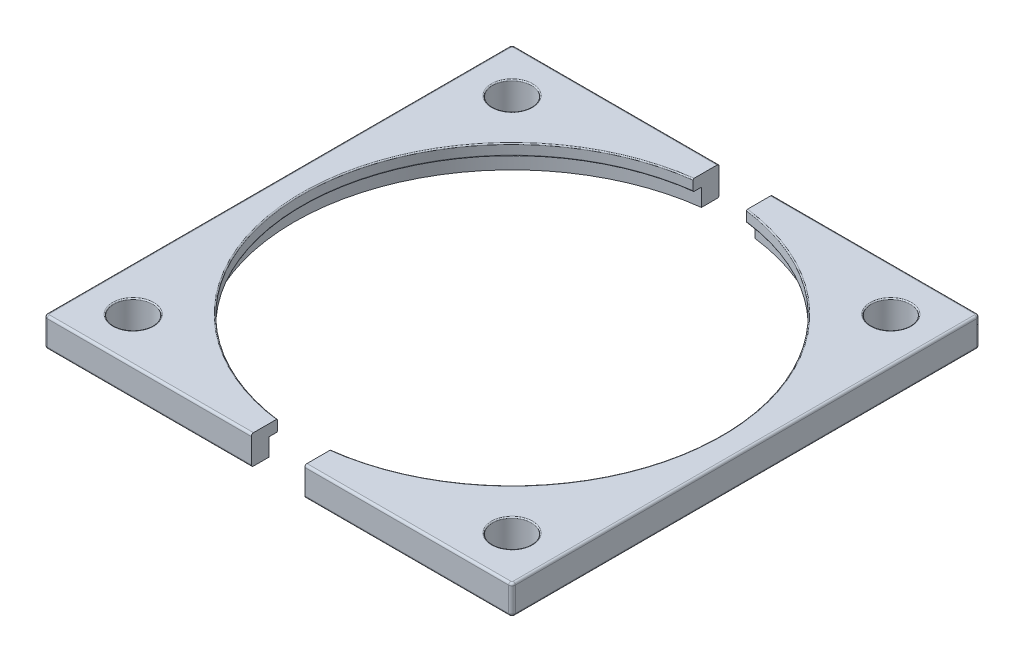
ISO-10303-21;
HEADER;
FILE_DESCRIPTION(('STEP AP214'),'2;1');
FILE_NAME('part.step','',(''),(''),'','','');
FILE_SCHEMA(('AUTOMOTIVE_DESIGN { 1 0 10303 214 1 1 1 1 }'));
ENDSEC;
DATA;
#1=APPLICATION_CONTEXT('core data for automotive mechanical design processes');
#2=APPLICATION_PROTOCOL_DEFINITION('international standard','automotive_design',2000,#1);
#3=PRODUCT_CONTEXT('',#1,'mechanical');
#4=PRODUCT('Part','Part','',(#3));
#5=PRODUCT_RELATED_PRODUCT_CATEGORY('part','',(#4));
#6=PRODUCT_DEFINITION_FORMATION('','',#4);
#7=PRODUCT_DEFINITION_CONTEXT('part definition',#1,'design');
#8=PRODUCT_DEFINITION('design','',#6,#7);
#9=PRODUCT_DEFINITION_SHAPE('','',#8);
#10=(LENGTH_UNIT() NAMED_UNIT(*) SI_UNIT(.MILLI.,.METRE.));
#11=(NAMED_UNIT(*) PLANE_ANGLE_UNIT() SI_UNIT($,.RADIAN.));
#12=(NAMED_UNIT(*) SI_UNIT($,.STERADIAN.) SOLID_ANGLE_UNIT());
#13=UNCERTAINTY_MEASURE_WITH_UNIT(LENGTH_MEASURE(1.E-05),#10,'distance_accuracy_value','');
#14=(GEOMETRIC_REPRESENTATION_CONTEXT(3) GLOBAL_UNCERTAINTY_ASSIGNED_CONTEXT((#13)) GLOBAL_UNIT_ASSIGNED_CONTEXT((#10,
#11,#12)) REPRESENTATION_CONTEXT('',''));
#15=CARTESIAN_POINT('',(0.,0.,0.));
#16=DIRECTION('',(0.,0.,1.));
#17=DIRECTION('',(1.,0.,0.));
#18=AXIS2_PLACEMENT_3D('',#15,#16,#17);
#19=CARTESIAN_POINT('',(0.,13.,0.));
#20=DIRECTION('',(0.,-1.,0.));
#21=DIRECTION('',(0.,0.,-1.));
#22=AXIS2_PLACEMENT_3D('',#19,#20,#21);
#23=CYLINDRICAL_SURFACE('',#22,94.);
#24=DIRECTION('',(0.,-1.,0.));
#25=VECTOR('',#24,1.);
#26=CARTESIAN_POINT('',(-12.,13.,93.2308961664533));
#27=LINE('',#26,#25);
#28=CARTESIAN_POINT('',(-12.,12.5,93.2308961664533));
#29=VERTEX_POINT('',#28);
#30=CARTESIAN_POINT('',(-12.,8.4,93.2308961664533));
#31=VERTEX_POINT('',#30);
#32=EDGE_CURVE('E252',#29,#31,#27,.T.);
#33=ORIENTED_EDGE('',*,*,#32,.T.);
#34=CARTESIAN_POINT('',(0.,8.4,0.));
#35=DIRECTION('',(0.,-1.,0.));
#36=DIRECTION('',(0.,0.,-1.));
#37=AXIS2_PLACEMENT_3D('',#34,#35,#36);
#38=CIRCLE('',#37,94.);
#39=CARTESIAN_POINT('',(-12.,8.4,-93.2308961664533));
#40=VERTEX_POINT('',#39);
#41=EDGE_CURVE('E371',#31,#40,#38,.T.);
#42=ORIENTED_EDGE('',*,*,#41,.T.);
#43=DIRECTION('',(0.,-1.,0.));
#44=VECTOR('',#43,1.);
#45=CARTESIAN_POINT('',(-12.,13.,-93.2308961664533));
#46=LINE('',#45,#44);
#47=CARTESIAN_POINT('',(-12.,12.5,-93.2308961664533));
#48=VERTEX_POINT('',#47);
#49=EDGE_CURVE('E248',#48,#40,#46,.T.);
#50=ORIENTED_EDGE('',*,*,#49,.F.);
#51=CARTESIAN_POINT('',(0.,12.5,0.));
#52=DIRECTION('',(0.,1.,0.));
#53=DIRECTION('',(0.,0.,1.));
#54=AXIS2_PLACEMENT_3D('',#51,#52,#53);
#55=CIRCLE('',#54,94.);
#56=EDGE_CURVE('E373',#48,#29,#55,.T.);
#57=ORIENTED_EDGE('',*,*,#56,.T.);
#58=EDGE_LOOP('',(#33,#42,#50,#57));
#59=FACE_BOUND('',#58,.T.);
#60=ADVANCED_FACE('F49',(#59),#23,.F.);
#61=CARTESIAN_POINT('',(-103.5,13.,103.5));
#62=DIRECTION('',(0.,1.,0.));
#63=DIRECTION('',(0.,0.,1.));
#64=AXIS2_PLACEMENT_3D('',#61,#62,#63);
#65=PLANE('',#64);
#66=DIRECTION('',(0.,0.,-1.));
#67=VECTOR('',#66,1.);
#68=CARTESIAN_POINT('',(-12.,13.,-105.));
#69=LINE('',#68,#67);
#70=CARTESIAN_POINT('',(-12.,13.,-93.734998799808));
#71=VERTEX_POINT('',#70);
#72=CARTESIAN_POINT('',(-12.,13.,-104.));
#73=VERTEX_POINT('',#72);
#74=EDGE_CURVE('E226',#71,#73,#69,.T.);
#75=ORIENTED_EDGE('',*,*,#74,.T.);
#76=DIRECTION('',(-1.,0.,0.));
#77=VECTOR('',#76,1.);
#78=CARTESIAN_POINT('',(-103.5,13.,-104.));
#79=LINE('',#78,#77);
#80=CARTESIAN_POINT('',(-103.5,13.,-104.));
#81=VERTEX_POINT('',#80);
#82=EDGE_CURVE('E500',#73,#81,#79,.T.);
#83=ORIENTED_EDGE('',*,*,#82,.T.);
#84=CARTESIAN_POINT('',(-103.5,13.,-103.5));
#85=DIRECTION('',(0.,1.,0.));
#86=DIRECTION('',(0.,0.,1.));
#87=AXIS2_PLACEMENT_3D('',#84,#85,#86);
#88=CIRCLE('',#87,0.500000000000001);
#89=CARTESIAN_POINT('',(-104.,13.,-103.5));
#90=VERTEX_POINT('',#89);
#91=EDGE_CURVE('E504',#81,#90,#88,.T.);
#92=ORIENTED_EDGE('',*,*,#91,.T.);
#93=DIRECTION('',(0.,0.,1.));
#94=VECTOR('',#93,1.);
#95=CARTESIAN_POINT('',(-104.,13.,103.5));
#96=LINE('',#95,#94);
#97=CARTESIAN_POINT('',(-104.,13.,103.5));
#98=VERTEX_POINT('',#97);
#99=EDGE_CURVE('E510',#90,#98,#96,.T.);
#100=ORIENTED_EDGE('',*,*,#99,.T.);
#101=CARTESIAN_POINT('',(-103.5,13.,103.5));
#102=DIRECTION('',(0.,1.,0.));
#103=DIRECTION('',(0.,0.,1.));
#104=AXIS2_PLACEMENT_3D('',#101,#102,#103);
#105=CIRCLE('',#104,0.500000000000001);
#106=CARTESIAN_POINT('',(-103.5,13.,104.));
#107=VERTEX_POINT('',#106);
#108=EDGE_CURVE('E471',#98,#107,#105,.T.);
#109=ORIENTED_EDGE('',*,*,#108,.T.);
#110=DIRECTION('',(1.,0.,0.));
#111=VECTOR('',#110,1.);
#112=CARTESIAN_POINT('',(-12.,13.,104.));
#113=LINE('',#112,#111);
#114=CARTESIAN_POINT('',(-12.,13.,104.));
#115=VERTEX_POINT('',#114);
#116=EDGE_CURVE('E400',#107,#115,#113,.T.);
#117=ORIENTED_EDGE('',*,*,#116,.T.);
#118=DIRECTION('',(0.,0.,-1.));
#119=VECTOR('',#118,1.);
#120=CARTESIAN_POINT('',(-12.,13.,93.2308961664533));
#121=LINE('',#120,#119);
#122=CARTESIAN_POINT('',(-12.,13.,93.734998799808));
#123=VERTEX_POINT('',#122);
#124=EDGE_CURVE('E223',#115,#123,#121,.T.);
#125=ORIENTED_EDGE('',*,*,#124,.T.);
#126=CARTESIAN_POINT('',(0.,13.,0.));
#127=DIRECTION('',(0.,1.,0.));
#128=DIRECTION('',(0.,0.,1.));
#129=AXIS2_PLACEMENT_3D('',#126,#127,#128);
#130=CIRCLE('',#129,94.5);
#131=EDGE_CURVE('E391',#123,#71,#130,.F.);
#132=ORIENTED_EDGE('',*,*,#131,.T.);
#133=EDGE_LOOP('',(#75,#83,#92,#100,#109,#117,#125,#132));
#134=FACE_BOUND('',#133,.T.);
#135=CARTESIAN_POINT('',(-85.,13.,85.));
#136=DIRECTION('',(0.,1.,0.));
#137=DIRECTION('',(0.,0.,1.));
#138=AXIS2_PLACEMENT_3D('',#135,#136,#137);
#139=CIRCLE('',#138,9.25000000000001);
#140=CARTESIAN_POINT('',(-85.,13.,94.25));
#141=VERTEX_POINT('',#140);
#142=EDGE_CURVE('E521',#141,#141,#139,.F.);
#143=ORIENTED_EDGE('',*,*,#142,.T.);
#144=EDGE_LOOP('',(#143));
#145=FACE_BOUND('',#144,.T.);
#146=CARTESIAN_POINT('',(-85.,13.,-85.));
#147=DIRECTION('',(0.,1.,0.));
#148=DIRECTION('',(0.,0.,1.));
#149=AXIS2_PLACEMENT_3D('',#146,#147,#148);
#150=CIRCLE('',#149,9.25000000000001);
#151=CARTESIAN_POINT('',(-85.,13.,-75.75));
#152=VERTEX_POINT('',#151);
#153=EDGE_CURVE('E320',#152,#152,#150,.F.);
#154=ORIENTED_EDGE('',*,*,#153,.T.);
#155=EDGE_LOOP('',(#154));
#156=FACE_BOUND('',#155,.T.);
#157=ADVANCED_FACE('F347',(#134,#145,#156),#65,.T.);
#158=CARTESIAN_POINT('',(-103.5,0.,103.5));
#159=DIRECTION('',(0.,1.,0.));
#160=DIRECTION('',(0.,0.,1.));
#161=AXIS2_PLACEMENT_3D('',#158,#159,#160);
#162=PLANE('',#161);
#163=CARTESIAN_POINT('',(-103.5,0.,-103.5));
#164=DIRECTION('',(0.,1.,0.));
#165=DIRECTION('',(0.,0.,1.));
#166=AXIS2_PLACEMENT_3D('',#163,#164,#165);
#167=CIRCLE('',#166,0.500000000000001);
#168=CARTESIAN_POINT('',(-104.,0.,-103.5));
#169=VERTEX_POINT('',#168);
#170=CARTESIAN_POINT('',(-103.5,0.,-104.));
#171=VERTEX_POINT('',#170);
#172=EDGE_CURVE('E67',#169,#171,#167,.F.);
#173=ORIENTED_EDGE('',*,*,#172,.T.);
#174=DIRECTION('',(-1.,0.,0.));
#175=VECTOR('',#174,1.);
#176=CARTESIAN_POINT('',(-103.5,0.,-104.));
#177=LINE('',#176,#175);
#178=CARTESIAN_POINT('',(-12.,0.,-104.));
#179=VERTEX_POINT('',#178);
#180=EDGE_CURVE('E430',#171,#179,#177,.F.);
#181=ORIENTED_EDGE('',*,*,#180,.T.);
#182=DIRECTION('',(0.,0.,-1.));
#183=VECTOR('',#182,1.);
#184=CARTESIAN_POINT('',(-12.,0.,-105.));
#185=LINE('',#184,#183);
#186=CARTESIAN_POINT('',(-12.,0.,-97.0106308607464));
#187=VERTEX_POINT('',#186);
#188=EDGE_CURVE('E186',#187,#179,#185,.T.);
#189=ORIENTED_EDGE('',*,*,#188,.F.);
#190=CARTESIAN_POINT('',(0.,0.,0.));
#191=DIRECTION('',(0.,-1.,0.));
#192=DIRECTION('',(0.,0.,-1.));
#193=AXIS2_PLACEMENT_3D('',#190,#191,#192);
#194=CIRCLE('',#193,97.75);
#195=CARTESIAN_POINT('',(-12.,0.,97.0106308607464));
#196=VERTEX_POINT('',#195);
#197=EDGE_CURVE('E193',#196,#187,#194,.T.);
#198=ORIENTED_EDGE('',*,*,#197,.F.);
#199=DIRECTION('',(0.,0.,-1.));
#200=VECTOR('',#199,1.);
#201=CARTESIAN_POINT('',(-12.,0.,93.2308961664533));
#202=LINE('',#201,#200);
#203=CARTESIAN_POINT('',(-12.,0.,104.));
#204=VERTEX_POINT('',#203);
#205=EDGE_CURVE('E175',#204,#196,#202,.T.);
#206=ORIENTED_EDGE('',*,*,#205,.F.);
#207=DIRECTION('',(1.,0.,0.));
#208=VECTOR('',#207,1.);
#209=CARTESIAN_POINT('',(-103.5,0.,104.));
#210=LINE('',#209,#208);
#211=CARTESIAN_POINT('',(-103.5,0.,104.));
#212=VERTEX_POINT('',#211);
#213=EDGE_CURVE('E74',#204,#212,#210,.F.);
#214=ORIENTED_EDGE('',*,*,#213,.T.);
#215=CARTESIAN_POINT('',(-103.5,0.,103.5));
#216=DIRECTION('',(0.,1.,0.));
#217=DIRECTION('',(0.,0.,1.));
#218=AXIS2_PLACEMENT_3D('',#215,#216,#217);
#219=CIRCLE('',#218,0.500000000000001);
#220=CARTESIAN_POINT('',(-104.,0.,103.5));
#221=VERTEX_POINT('',#220);
#222=EDGE_CURVE('E424',#212,#221,#219,.F.);
#223=ORIENTED_EDGE('',*,*,#222,.T.);
#224=DIRECTION('',(0.,0.,1.));
#225=VECTOR('',#224,1.);
#226=CARTESIAN_POINT('',(-104.,0.,103.5));
#227=LINE('',#226,#225);
#228=EDGE_CURVE('E422',#221,#169,#227,.F.);
#229=ORIENTED_EDGE('',*,*,#228,.T.);
#230=EDGE_LOOP('',(#173,#181,#189,#198,#206,#214,#223,#229));
#231=FACE_BOUND('',#230,.T.);
#232=CARTESIAN_POINT('',(-85.,0.,-85.));
#233=DIRECTION('',(0.,1.,0.));
#234=DIRECTION('',(0.,0.,1.));
#235=AXIS2_PLACEMENT_3D('',#232,#233,#234);
#236=CIRCLE('',#235,8.75000000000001);
#237=CARTESIAN_POINT('',(-85.,0.,-93.75));
#238=VERTEX_POINT('',#237);
#239=EDGE_CURVE('E187',#238,#238,#236,.T.);
#240=ORIENTED_EDGE('',*,*,#239,.T.);
#241=EDGE_LOOP('',(#240));
#242=FACE_BOUND('',#241,.T.);
#243=CARTESIAN_POINT('',(-85.,0.,85.));
#244=DIRECTION('',(0.,1.,0.));
#245=DIRECTION('',(0.,0.,-1.));
#246=AXIS2_PLACEMENT_3D('',#243,#244,#245);
#247=CIRCLE('',#246,8.75000000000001);
#248=CARTESIAN_POINT('',(-85.,0.,76.25));
#249=VERTEX_POINT('',#248);
#250=EDGE_CURVE('E197',#249,#249,#247,.T.);
#251=ORIENTED_EDGE('',*,*,#250,.T.);
#252=EDGE_LOOP('',(#251));
#253=FACE_BOUND('',#252,.T.);
#254=ADVANCED_FACE('F201',(#231,#242,#253),#162,.F.);
#255=CARTESIAN_POINT('',(-103.5,13.,103.5));
#256=DIRECTION('',(0.,-1.,0.));
#257=DIRECTION('',(0.,0.,-1.));
#258=AXIS2_PLACEMENT_3D('',#255,#256,#257);
#259=CYLINDRICAL_SURFACE('',#258,1.5);
#260=DIRECTION('',(0.,-1.,0.));
#261=VECTOR('',#260,1.);
#262=CARTESIAN_POINT('',(-103.5,13.,105.));
#263=LINE('',#262,#261);
#264=CARTESIAN_POINT('',(-103.5,12.,105.));
#265=VERTEX_POINT('',#264);
#266=CARTESIAN_POINT('',(-103.5,0.999999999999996,105.));
#267=VERTEX_POINT('',#266);
#268=EDGE_CURVE('E259',#265,#267,#263,.T.);
#269=ORIENTED_EDGE('',*,*,#268,.F.);
#270=CARTESIAN_POINT('',(-103.5,12.,103.5));
#271=DIRECTION('',(0.,1.,0.));
#272=DIRECTION('',(0.,0.,1.));
#273=AXIS2_PLACEMENT_3D('',#270,#271,#272);
#274=CIRCLE('',#273,1.5);
#275=CARTESIAN_POINT('',(-105.,12.,103.5));
#276=VERTEX_POINT('',#275);
#277=EDGE_CURVE('E419',#265,#276,#274,.F.);
#278=ORIENTED_EDGE('',*,*,#277,.T.);
#279=DIRECTION('',(0.,-1.,0.));
#280=VECTOR('',#279,1.);
#281=CARTESIAN_POINT('',(-105.,13.,103.5));
#282=LINE('',#281,#280);
#283=CARTESIAN_POINT('',(-105.,1.,103.5));
#284=VERTEX_POINT('',#283);
#285=EDGE_CURVE('E229',#276,#284,#282,.T.);
#286=ORIENTED_EDGE('',*,*,#285,.T.);
#287=CARTESIAN_POINT('',(-103.5,0.999999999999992,103.5));
#288=DIRECTION('',(0.,1.,0.));
#289=DIRECTION('',(0.,0.,1.));
#290=AXIS2_PLACEMENT_3D('',#287,#288,#289);
#291=CIRCLE('',#290,1.5);
#292=EDGE_CURVE('E416',#284,#267,#291,.T.);
#293=ORIENTED_EDGE('',*,*,#292,.T.);
#294=EDGE_LOOP('',(#269,#278,#286,#293));
#295=FACE_BOUND('',#294,.T.);
#296=ADVANCED_FACE('F302',(#295),#259,.T.);
#297=CARTESIAN_POINT('',(-103.5,13.,105.));
#298=DIRECTION('',(0.,0.,-1.));
#299=DIRECTION('',(-1.,0.,0.));
#300=AXIS2_PLACEMENT_3D('',#297,#298,#299);
#301=PLANE('',#300);
#302=DIRECTION('',(0.,-1.,0.));
#303=VECTOR('',#302,1.);
#304=CARTESIAN_POINT('',(-12.,13.,105.));
#305=LINE('',#304,#303);
#306=CARTESIAN_POINT('',(-12.,12.,105.));
#307=VERTEX_POINT('',#306);
#308=CARTESIAN_POINT('',(-12.,1.,105.));
#309=VERTEX_POINT('',#308);
#310=EDGE_CURVE('E256',#307,#309,#305,.T.);
#311=ORIENTED_EDGE('',*,*,#310,.F.);
#312=DIRECTION('',(1.,0.,0.));
#313=VECTOR('',#312,1.);
#314=CARTESIAN_POINT('',(-103.5,12.,105.));
#315=LINE('',#314,#313);
#316=EDGE_CURVE('E401',#307,#265,#315,.F.);
#317=ORIENTED_EDGE('',*,*,#316,.T.);
#318=ORIENTED_EDGE('',*,*,#268,.T.);
#319=DIRECTION('',(1.,0.,0.));
#320=VECTOR('',#319,1.);
#321=CARTESIAN_POINT('',(-103.5,0.999999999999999,105.));
#322=LINE('',#321,#320);
#323=EDGE_CURVE('E403',#267,#309,#322,.T.);
#324=ORIENTED_EDGE('',*,*,#323,.T.);
#325=EDGE_LOOP('',(#311,#317,#318,#324));
#326=FACE_BOUND('',#325,.T.);
#327=ADVANCED_FACE('F297',(#326),#301,.F.);
#328=CARTESIAN_POINT('',(-12.,13.,93.2308961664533));
#329=DIRECTION('',(-1.,0.,0.));
#330=DIRECTION('',(0.,0.,1.));
#331=AXIS2_PLACEMENT_3D('',#328,#329,#330);
#332=PLANE('',#331);
#333=ORIENTED_EDGE('',*,*,#124,.F.);
#334=CARTESIAN_POINT('',(-12.,12.,104.));
#335=DIRECTION('',(-1.,0.,0.));
#336=DIRECTION('',(0.,0.,1.));
#337=AXIS2_PLACEMENT_3D('',#334,#335,#336);
#338=CIRCLE('',#337,1.);
#339=EDGE_CURVE('E393',#115,#307,#338,.F.);
#340=ORIENTED_EDGE('',*,*,#339,.T.);
#341=ORIENTED_EDGE('',*,*,#310,.T.);
#342=CARTESIAN_POINT('',(-12.,0.999999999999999,104.));
#343=DIRECTION('',(-1.,0.,0.));
#344=DIRECTION('',(0.,0.,1.));
#345=AXIS2_PLACEMENT_3D('',#342,#343,#344);
#346=CIRCLE('',#345,1.);
#347=EDGE_CURVE('E183',#309,#204,#346,.F.);
#348=ORIENTED_EDGE('',*,*,#347,.T.);
#349=ORIENTED_EDGE('',*,*,#205,.T.);
#350=DIRECTION('',(0.,-1.,0.));
#351=VECTOR('',#350,1.);
#352=CARTESIAN_POINT('',(-12.,7.9,97.0106308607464));
#353=LINE('',#352,#351);
#354=CARTESIAN_POINT('',(-12.,7.9,97.0106308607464));
#355=VERTEX_POINT('',#354);
#356=EDGE_CURVE('E180',#196,#355,#353,.F.);
#357=ORIENTED_EDGE('',*,*,#356,.T.);
#358=DIRECTION('',(0.,0.,1.));
#359=VECTOR('',#358,1.);
#360=CARTESIAN_POINT('',(-12.,7.9,93.2308961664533));
#361=LINE('',#360,#359);
#362=CARTESIAN_POINT('',(-12.,7.9,93.734998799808));
#363=VERTEX_POINT('',#362);
#364=EDGE_CURVE('E198',#363,#355,#361,.T.);
#365=ORIENTED_EDGE('',*,*,#364,.F.);
#366=CARTESIAN_POINT('',(-12.,7.9,93.734998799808));
#367=CARTESIAN_POINT('',(-12.,7.89997690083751,93.7064696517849));
#368=CARTESIAN_POINT('',(-12.,7.90240102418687,93.6779463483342));
#369=CARTESIAN_POINT('',(-12.,7.91197465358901,93.6217193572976));
#370=CARTESIAN_POINT('',(-12.,7.91912156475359,93.5940152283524));
#371=CARTESIAN_POINT('',(-12.,7.93797731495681,93.5401864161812));
#372=CARTESIAN_POINT('',(-12.,7.94968870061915,93.5140626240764));
#373=CARTESIAN_POINT('',(-12.,7.97734266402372,93.464167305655));
#374=CARTESIAN_POINT('',(-12.,7.9932842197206,93.4403952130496));
#375=CARTESIAN_POINT('',(-12.,8.02889388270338,93.3959710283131));
#376=CARTESIAN_POINT('',(-12.,8.04854814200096,93.375307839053));
#377=CARTESIAN_POINT('',(-12.,8.09107580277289,93.33760133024));
#378=CARTESIAN_POINT('',(-12.,8.11394977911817,93.3205586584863));
#379=CARTESIAN_POINT('',(-12.,8.16207639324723,93.2907214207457));
#380=CARTESIAN_POINT('',(-12.,8.18730980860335,93.2778958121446));
#381=CARTESIAN_POINT('',(-12.,8.23957671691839,93.2567063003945));
#382=CARTESIAN_POINT('',(-12.,8.26660892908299,93.2483392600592));
#383=CARTESIAN_POINT('',(-12.,8.31152336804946,93.2385266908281));
#384=CARTESIAN_POINT('',(-12.,8.32910918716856,93.2356669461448));
#385=CARTESIAN_POINT('',(-12.,8.36446072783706,93.2318520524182));
#386=CARTESIAN_POINT('',(-12.,8.3822261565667,93.230894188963));
#387=CARTESIAN_POINT('',(-12.,8.4,93.2308961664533));
#388=B_SPLINE_CURVE_WITH_KNOTS('',3,(#366,#367,#368,#369,#370,#371,#372,#373,#374,#375,#376,
#377,#378,#379,#380,#381,#382,#383,#384,#385,#386,#387),.UNSPECIFIED.,.F.,.F.,(4,2,2,2,2,2,2,2,
2,2,4),(0.,0.0854765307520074,0.170906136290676,0.256383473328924,0.341840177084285,
0.426984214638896,0.512143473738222,0.596661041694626,0.681119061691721,0.734474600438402,
0.78775393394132),.UNSPECIFIED.);
#389=EDGE_CURVE('E283',#363,#31,#388,.T.);
#390=ORIENTED_EDGE('',*,*,#389,.T.);
#391=ORIENTED_EDGE('',*,*,#32,.F.);
#392=CARTESIAN_POINT('',(-12.,12.5,93.2308961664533));
#393=CARTESIAN_POINT('',(-12.,12.5279627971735,93.2308713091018));
#394=CARTESIAN_POINT('',(-12.,12.5559170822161,93.233259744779));
#395=CARTESIAN_POINT('',(-12.,12.6110044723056,93.2426781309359));
#396=CARTESIAN_POINT('',(-12.,12.6381383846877,93.2497033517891));
#397=CARTESIAN_POINT('',(-12.,12.6908515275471,93.2682146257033));
#398=CARTESIAN_POINT('',(-12.,12.7164301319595,93.2797024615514));
#399=CARTESIAN_POINT('',(-12.,12.7653023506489,93.3067911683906));
#400=CARTESIAN_POINT('',(-12.,12.7885962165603,93.3223915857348));
#401=CARTESIAN_POINT('',(-12.,12.8323370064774,93.3573182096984));
#402=CARTESIAN_POINT('',(-12.,12.8527733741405,93.3766576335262));
#403=CARTESIAN_POINT('',(-12.,12.8901434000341,93.4184734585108));
#404=CARTESIAN_POINT('',(-12.,12.9070763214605,93.4409505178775));
#405=CARTESIAN_POINT('',(-12.,12.9370961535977,93.4885877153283));
#406=CARTESIAN_POINT('',(-12.,12.9501515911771,93.5137676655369));
#407=CARTESIAN_POINT('',(-12.,12.9718789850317,93.5659469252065));
#408=CARTESIAN_POINT('',(-12.,12.9805530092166,93.592945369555));
#409=CARTESIAN_POINT('',(-12.,12.9912679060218,93.6392374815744));
#410=CARTESIAN_POINT('',(-12.,12.9945404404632,93.6582555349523));
#411=CARTESIAN_POINT('',(-12.,12.9989063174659,93.6965128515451));
#412=CARTESIAN_POINT('',(-12.,13.0000027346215,93.7157517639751));
#413=CARTESIAN_POINT('',(-12.,13.,93.734998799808));
#414=B_SPLINE_CURVE_WITH_KNOTS('',3,(#392,#393,#394,#395,#396,#397,#398,#399,#400,#401,#402,
#403,#404,#405,#406,#407,#408,#409,#410,#411,#412,#413),.UNSPECIFIED.,.F.,.F.,(4,2,2,2,2,2,2,2,
2,2,4),(0.,0.0837741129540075,0.167462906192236,0.251185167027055,0.33489819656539,
0.418912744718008,0.502944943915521,0.587641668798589,0.672298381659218,0.730074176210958,
0.787768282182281),.UNSPECIFIED.);
#415=EDGE_CURVE('E274',#29,#123,#414,.T.);
#416=ORIENTED_EDGE('',*,*,#415,.T.);
#417=EDGE_LOOP('',(#333,#340,#341,#348,#349,#357,#365,#390,#391,#416));
#418=FACE_BOUND('',#417,.T.);
#419=ADVANCED_FACE('F178',(#418),#332,.F.);
#420=CARTESIAN_POINT('',(-12.,13.,-105.));
#421=DIRECTION('',(-1.,0.,0.));
#422=DIRECTION('',(0.,0.,1.));
#423=AXIS2_PLACEMENT_3D('',#420,#421,#422);
#424=PLANE('',#423);
#425=DIRECTION('',(0.,-1.,0.));
#426=VECTOR('',#425,1.);
#427=CARTESIAN_POINT('',(-12.,13.,-105.));
#428=LINE('',#427,#426);
#429=CARTESIAN_POINT('',(-12.,12.,-105.));
#430=VERTEX_POINT('',#429);
#431=CARTESIAN_POINT('',(-12.,1.,-105.));
#432=VERTEX_POINT('',#431);
#433=EDGE_CURVE('E244',#430,#432,#428,.T.);
#434=ORIENTED_EDGE('',*,*,#433,.F.);
#435=CARTESIAN_POINT('',(-12.,12.,-104.));
#436=DIRECTION('',(-1.,0.,0.));
#437=DIRECTION('',(0.,0.,1.));
#438=AXIS2_PLACEMENT_3D('',#435,#436,#437);
#439=CIRCLE('',#438,1.);
#440=EDGE_CURVE('E485',#430,#73,#439,.F.);
#441=ORIENTED_EDGE('',*,*,#440,.T.);
#442=ORIENTED_EDGE('',*,*,#74,.F.);
#443=CARTESIAN_POINT('',(-12.,13.,-93.734998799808));
#444=CARTESIAN_POINT('',(-12.,13.0000230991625,-93.7064696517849));
#445=CARTESIAN_POINT('',(-12.,12.9975989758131,-93.6779463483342));
#446=CARTESIAN_POINT('',(-12.,12.988025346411,-93.6217193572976));
#447=CARTESIAN_POINT('',(-12.,12.9808784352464,-93.5940152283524));
#448=CARTESIAN_POINT('',(-12.,12.9620226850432,-93.5401864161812));
#449=CARTESIAN_POINT('',(-12.,12.9503112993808,-93.5140626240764));
#450=CARTESIAN_POINT('',(-12.,12.9226573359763,-93.464167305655));
#451=CARTESIAN_POINT('',(-12.,12.9067157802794,-93.4403952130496));
#452=CARTESIAN_POINT('',(-12.,12.8711061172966,-93.3959710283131));
#453=CARTESIAN_POINT('',(-12.,12.851451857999,-93.375307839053));
#454=CARTESIAN_POINT('',(-12.,12.8089241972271,-93.33760133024));
#455=CARTESIAN_POINT('',(-12.,12.7860502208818,-93.3205586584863));
#456=CARTESIAN_POINT('',(-12.,12.7379236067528,-93.2907214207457));
#457=CARTESIAN_POINT('',(-12.,12.7126901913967,-93.2778958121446));
#458=CARTESIAN_POINT('',(-12.,12.6604232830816,-93.2567063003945));
#459=CARTESIAN_POINT('',(-12.,12.633391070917,-93.2483392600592));
#460=CARTESIAN_POINT('',(-12.,12.5884766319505,-93.2385266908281));
#461=CARTESIAN_POINT('',(-12.,12.5708908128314,-93.2356669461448));
#462=CARTESIAN_POINT('',(-12.,12.5355392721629,-93.2318520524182));
#463=CARTESIAN_POINT('',(-12.,12.5177738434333,-93.230894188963));
#464=CARTESIAN_POINT('',(-12.,12.5,-93.2308961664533));
#465=B_SPLINE_CURVE_WITH_KNOTS('',3,(#443,#444,#445,#446,#447,#448,#449,#450,#451,#452,#453,
#454,#455,#456,#457,#458,#459,#460,#461,#462,#463,#464),.UNSPECIFIED.,.F.,.F.,(4,2,2,2,2,2,2,2,
2,2,4),(0.,0.0854765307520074,0.170906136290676,0.256383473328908,0.341840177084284,
0.426984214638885,0.512143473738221,0.596661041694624,0.681119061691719,0.734474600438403,
0.787753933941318),.UNSPECIFIED.);
#466=EDGE_CURVE('E321',#71,#48,#465,.T.);
#467=ORIENTED_EDGE('',*,*,#466,.T.);
#468=ORIENTED_EDGE('',*,*,#49,.T.);
#469=CARTESIAN_POINT('',(-12.,8.4,-93.2308961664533));
#470=CARTESIAN_POINT('',(-12.,8.37203720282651,-93.2308713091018));
#471=CARTESIAN_POINT('',(-12.,8.34408291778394,-93.233259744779));
#472=CARTESIAN_POINT('',(-12.,8.28899552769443,-93.2426781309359));
#473=CARTESIAN_POINT('',(-12.,8.26186161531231,-93.2497033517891));
#474=CARTESIAN_POINT('',(-12.,8.20914847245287,-93.2682146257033));
#475=CARTESIAN_POINT('',(-12.,8.18356986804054,-93.2797024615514));
#476=CARTESIAN_POINT('',(-12.,8.13469764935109,-93.3067911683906));
#477=CARTESIAN_POINT('',(-12.,8.11140378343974,-93.3223915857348));
#478=CARTESIAN_POINT('',(-12.,8.0676629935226,-93.3573182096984));
#479=CARTESIAN_POINT('',(-12.,8.04722662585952,-93.3766576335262));
#480=CARTESIAN_POINT('',(-12.,8.00985659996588,-93.4184734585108));
#481=CARTESIAN_POINT('',(-12.,7.99292367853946,-93.4409505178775));
#482=CARTESIAN_POINT('',(-12.,7.96290384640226,-93.4885877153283));
#483=CARTESIAN_POINT('',(-12.,7.94984840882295,-93.5137676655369));
#484=CARTESIAN_POINT('',(-12.,7.92812101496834,-93.5659469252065));
#485=CARTESIAN_POINT('',(-12.,7.91944699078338,-93.592945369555));
#486=CARTESIAN_POINT('',(-12.,7.90873209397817,-93.6392374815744));
#487=CARTESIAN_POINT('',(-12.,7.90545955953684,-93.6582555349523));
#488=CARTESIAN_POINT('',(-12.,7.90109368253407,-93.6965128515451));
#489=CARTESIAN_POINT('',(-12.,7.89999726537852,-93.7157517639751));
#490=CARTESIAN_POINT('',(-12.,7.9,-93.734998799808));
#491=B_SPLINE_CURVE_WITH_KNOTS('',3,(#469,#470,#471,#472,#473,#474,#475,#476,#477,#478,#479,
#480,#481,#482,#483,#484,#485,#486,#487,#488,#489,#490),.UNSPECIFIED.,.F.,.F.,(4,2,2,2,2,2,2,2,
2,2,4),(0.,0.0837741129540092,0.167462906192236,0.251185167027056,0.33489819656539,
0.418912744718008,0.502944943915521,0.587641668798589,0.672298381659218,0.730074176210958,
0.787768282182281),.UNSPECIFIED.);
#492=CARTESIAN_POINT('',(-12.,7.9,-93.734998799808));
#493=VERTEX_POINT('',#492);
#494=EDGE_CURVE('E313',#40,#493,#491,.T.);
#495=ORIENTED_EDGE('',*,*,#494,.T.);
#496=DIRECTION('',(0.,0.,1.));
#497=VECTOR('',#496,1.);
#498=CARTESIAN_POINT('',(-12.,7.9,-105.));
#499=LINE('',#498,#497);
#500=CARTESIAN_POINT('',(-12.,7.9,-97.0106308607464));
#501=VERTEX_POINT('',#500);
#502=EDGE_CURVE('E263',#501,#493,#499,.T.);
#503=ORIENTED_EDGE('',*,*,#502,.F.);
#504=DIRECTION('',(0.,-1.,0.));
#505=VECTOR('',#504,1.);
#506=CARTESIAN_POINT('',(-12.,7.9,-97.0106308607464));
#507=LINE('',#506,#505);
#508=EDGE_CURVE('E267',#501,#187,#507,.T.);
#509=ORIENTED_EDGE('',*,*,#508,.T.);
#510=ORIENTED_EDGE('',*,*,#188,.T.);
#511=CARTESIAN_POINT('',(-12.,0.999999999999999,-104.));
#512=DIRECTION('',(-1.,0.,0.));
#513=DIRECTION('',(0.,0.,1.));
#514=AXIS2_PLACEMENT_3D('',#511,#512,#513);
#515=CIRCLE('',#514,1.);
#516=EDGE_CURVE('E490',#179,#432,#515,.F.);
#517=ORIENTED_EDGE('',*,*,#516,.T.);
#518=EDGE_LOOP('',(#434,#441,#442,#467,#468,#495,#503,#509,#510,#517));
#519=FACE_BOUND('',#518,.T.);
#520=ADVANCED_FACE('F296',(#519),#424,.F.);
#521=CARTESIAN_POINT('',(-103.5,13.,-105.));
#522=DIRECTION('',(0.,0.,1.));
#523=DIRECTION('',(1.,0.,0.));
#524=AXIS2_PLACEMENT_3D('',#521,#522,#523);
#525=PLANE('',#524);
#526=DIRECTION('',(0.,-1.,0.));
#527=VECTOR('',#526,1.);
#528=CARTESIAN_POINT('',(-103.5,13.,-105.));
#529=LINE('',#528,#527);
#530=CARTESIAN_POINT('',(-103.5,12.,-105.));
#531=VERTEX_POINT('',#530);
#532=CARTESIAN_POINT('',(-103.5,0.999999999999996,-105.));
#533=VERTEX_POINT('',#532);
#534=EDGE_CURVE('E240',#531,#533,#529,.T.);
#535=ORIENTED_EDGE('',*,*,#534,.F.);
#536=DIRECTION('',(-1.,0.,0.));
#537=VECTOR('',#536,1.);
#538=CARTESIAN_POINT('',(-12.,12.,-105.));
#539=LINE('',#538,#537);
#540=EDGE_CURVE('E494',#531,#430,#539,.F.);
#541=ORIENTED_EDGE('',*,*,#540,.T.);
#542=ORIENTED_EDGE('',*,*,#433,.T.);
#543=DIRECTION('',(-1.,0.,0.));
#544=VECTOR('',#543,1.);
#545=CARTESIAN_POINT('',(-103.5,0.999999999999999,-105.));
#546=LINE('',#545,#544);
#547=EDGE_CURVE('E497',#432,#533,#546,.T.);
#548=ORIENTED_EDGE('',*,*,#547,.T.);
#549=EDGE_LOOP('',(#535,#541,#542,#548));
#550=FACE_BOUND('',#549,.T.);
#551=ADVANCED_FACE('F330',(#550),#525,.F.);
#552=CARTESIAN_POINT('',(-103.5,13.,-103.5));
#553=DIRECTION('',(0.,-1.,0.));
#554=DIRECTION('',(0.,0.,-1.));
#555=AXIS2_PLACEMENT_3D('',#552,#553,#554);
#556=CYLINDRICAL_SURFACE('',#555,1.5);
#557=DIRECTION('',(0.,-1.,0.));
#558=VECTOR('',#557,1.);
#559=CARTESIAN_POINT('',(-105.,13.,-103.5));
#560=LINE('',#559,#558);
#561=CARTESIAN_POINT('',(-105.,12.,-103.5));
#562=VERTEX_POINT('',#561);
#563=CARTESIAN_POINT('',(-105.,1.,-103.5));
#564=VERTEX_POINT('',#563);
#565=EDGE_CURVE('E236',#562,#564,#560,.T.);
#566=ORIENTED_EDGE('',*,*,#565,.F.);
#567=CARTESIAN_POINT('',(-103.5,12.,-103.5));
#568=DIRECTION('',(0.,1.,0.));
#569=DIRECTION('',(0.,0.,1.));
#570=AXIS2_PLACEMENT_3D('',#567,#568,#569);
#571=CIRCLE('',#570,1.5);
#572=EDGE_CURVE('E410',#562,#531,#571,.F.);
#573=ORIENTED_EDGE('',*,*,#572,.T.);
#574=ORIENTED_EDGE('',*,*,#534,.T.);
#575=CARTESIAN_POINT('',(-103.5,0.999999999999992,-103.5));
#576=DIRECTION('',(0.,1.,0.));
#577=DIRECTION('',(0.,0.,1.));
#578=AXIS2_PLACEMENT_3D('',#575,#576,#577);
#579=CIRCLE('',#578,1.5);
#580=EDGE_CURVE('E480',#533,#564,#579,.T.);
#581=ORIENTED_EDGE('',*,*,#580,.T.);
#582=EDGE_LOOP('',(#566,#573,#574,#581));
#583=FACE_BOUND('',#582,.T.);
#584=ADVANCED_FACE('F335',(#583),#556,.T.);
#585=CARTESIAN_POINT('',(-105.,13.,-103.5));
#586=DIRECTION('',(1.,0.,0.));
#587=DIRECTION('',(0.,0.,-1.));
#588=AXIS2_PLACEMENT_3D('',#585,#586,#587);
#589=PLANE('',#588);
#590=ORIENTED_EDGE('',*,*,#285,.F.);
#591=DIRECTION('',(0.,0.,1.));
#592=VECTOR('',#591,1.);
#593=CARTESIAN_POINT('',(-105.,12.,-103.5));
#594=LINE('',#593,#592);
#595=EDGE_CURVE('E12',#276,#562,#594,.F.);
#596=ORIENTED_EDGE('',*,*,#595,.T.);
#597=ORIENTED_EDGE('',*,*,#565,.T.);
#598=DIRECTION('',(0.,0.,1.));
#599=VECTOR('',#598,1.);
#600=CARTESIAN_POINT('',(-105.,0.999999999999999,-103.5));
#601=LINE('',#600,#599);
#602=EDGE_CURVE('E59',#564,#284,#601,.T.);
#603=ORIENTED_EDGE('',*,*,#602,.T.);
#604=EDGE_LOOP('',(#590,#596,#597,#603));
#605=FACE_BOUND('',#604,.T.);
#606=ADVANCED_FACE('F339',(#605),#589,.F.);
#607=CARTESIAN_POINT('',(-85.,13.,-85.));
#608=DIRECTION('',(0.,-1.,0.));
#609=DIRECTION('',(0.,0.,-1.));
#610=AXIS2_PLACEMENT_3D('',#607,#608,#609);
#611=CYLINDRICAL_SURFACE('',#610,8.75000000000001);
#612=CARTESIAN_POINT('',(-85.,12.5,-85.));
#613=DIRECTION('',(0.,1.,0.));
#614=DIRECTION('',(0.,0.,1.));
#615=AXIS2_PLACEMENT_3D('',#612,#613,#614);
#616=CIRCLE('',#615,8.75000000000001);
#617=CARTESIAN_POINT('',(-85.,12.5,-93.75));
#618=VERTEX_POINT('',#617);
#619=EDGE_CURVE('E512',#618,#618,#616,.T.);
#620=CARTESIAN_POINT('',(-85.,12.5,-93.75));
#621=CARTESIAN_POINT('',(-85.,12.3697916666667,-93.75));
#622=CARTESIAN_POINT('',(-85.,12.2395833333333,-93.75));
#623=CARTESIAN_POINT('',(-85.,11.9791666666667,-93.75));
#624=CARTESIAN_POINT('',(-85.,11.8489583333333,-93.75));
#625=CARTESIAN_POINT('',(-85.,11.5885416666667,-93.75));
#626=CARTESIAN_POINT('',(-85.,11.4583333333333,-93.75));
#627=CARTESIAN_POINT('',(-85.,11.1979166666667,-93.75));
#628=CARTESIAN_POINT('',(-85.,11.0677083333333,-93.75));
#629=CARTESIAN_POINT('',(-85.,10.8072916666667,-93.75));
#630=CARTESIAN_POINT('',(-85.,10.6770833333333,-93.75));
#631=CARTESIAN_POINT('',(-85.,10.4166666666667,-93.75));
#632=CARTESIAN_POINT('',(-85.,10.2864583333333,-93.75));
#633=CARTESIAN_POINT('',(-85.,10.0260416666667,-93.75));
#634=CARTESIAN_POINT('',(-85.,9.89583333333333,-93.75));
#635=CARTESIAN_POINT('',(-85.,9.63541666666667,-93.75));
#636=CARTESIAN_POINT('',(-85.,9.50520833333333,-93.75));
#637=CARTESIAN_POINT('',(-85.,9.24479166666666,-93.75));
#638=CARTESIAN_POINT('',(-85.,9.11458333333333,-93.75));
#639=CARTESIAN_POINT('',(-85.,8.85416666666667,-93.75));
#640=CARTESIAN_POINT('',(-85.,8.72395833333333,-93.75));
#641=CARTESIAN_POINT('',(-85.,8.46354166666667,-93.75));
#642=CARTESIAN_POINT('',(-85.,8.33333333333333,-93.75));
#643=CARTESIAN_POINT('',(-85.,8.07291666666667,-93.75));
#644=CARTESIAN_POINT('',(-85.,7.94270833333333,-93.75));
#645=CARTESIAN_POINT('',(-85.,7.68229166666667,-93.75));
#646=CARTESIAN_POINT('',(-85.,7.55208333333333,-93.75));
#647=CARTESIAN_POINT('',(-85.,7.29166666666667,-93.75));
#648=CARTESIAN_POINT('',(-85.,7.16145833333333,-93.75));
#649=CARTESIAN_POINT('',(-85.,6.90104166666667,-93.75));
#650=CARTESIAN_POINT('',(-85.,6.77083333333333,-93.75));
#651=CARTESIAN_POINT('',(-85.,6.51041666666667,-93.75));
#652=CARTESIAN_POINT('',(-85.,6.38020833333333,-93.75));
#653=CARTESIAN_POINT('',(-85.,6.11979166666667,-93.75));
#654=CARTESIAN_POINT('',(-85.,5.98958333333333,-93.75));
#655=CARTESIAN_POINT('',(-85.,5.72916666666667,-93.75));
#656=CARTESIAN_POINT('',(-85.,5.59895833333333,-93.75));
#657=CARTESIAN_POINT('',(-85.,5.33854166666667,-93.75));
#658=CARTESIAN_POINT('',(-85.,5.20833333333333,-93.75));
#659=CARTESIAN_POINT('',(-85.,4.94791666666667,-93.75));
#660=CARTESIAN_POINT('',(-85.,4.81770833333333,-93.75));
#661=CARTESIAN_POINT('',(-85.,4.55729166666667,-93.75));
#662=CARTESIAN_POINT('',(-85.,4.42708333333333,-93.75));
#663=CARTESIAN_POINT('',(-85.,4.16666666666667,-93.75));
#664=CARTESIAN_POINT('',(-85.,4.03645833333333,-93.75));
#665=CARTESIAN_POINT('',(-85.,3.77604166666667,-93.75));
#666=CARTESIAN_POINT('',(-85.,3.64583333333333,-93.75));
#667=CARTESIAN_POINT('',(-85.,3.38541666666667,-93.75));
#668=CARTESIAN_POINT('',(-85.,3.25520833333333,-93.75));
#669=CARTESIAN_POINT('',(-85.,2.99479166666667,-93.75));
#670=CARTESIAN_POINT('',(-85.,2.86458333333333,-93.75));
#671=CARTESIAN_POINT('',(-85.,2.60416666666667,-93.75));
#672=CARTESIAN_POINT('',(-85.,2.47395833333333,-93.75));
#673=CARTESIAN_POINT('',(-85.,2.21354166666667,-93.75));
#674=CARTESIAN_POINT('',(-85.,2.08333333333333,-93.75));
#675=CARTESIAN_POINT('',(-85.,1.82291666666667,-93.75));
#676=CARTESIAN_POINT('',(-85.,1.69270833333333,-93.75));
#677=CARTESIAN_POINT('',(-85.,1.43229166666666,-93.75));
#678=CARTESIAN_POINT('',(-85.,1.30208333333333,-93.75));
#679=CARTESIAN_POINT('',(-85.,1.04166666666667,-93.75));
#680=CARTESIAN_POINT('',(-85.,0.911458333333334,-93.75));
#681=CARTESIAN_POINT('',(-85.,0.651041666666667,-93.75));
#682=CARTESIAN_POINT('',(-85.,0.520833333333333,-93.75));
#683=CARTESIAN_POINT('',(-85.,0.260416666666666,-93.75));
#684=CARTESIAN_POINT('',(-85.,0.130208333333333,-93.75));
#685=CARTESIAN_POINT('',(-85.,0.,-93.75));
#686=B_SPLINE_CURVE_WITH_KNOTS('',3,(#620,#621,#622,#623,#624,#625,#626,#627,#628,#629,#630,
#631,#632,#633,#634,#635,#636,#637,#638,#639,#640,#641,#642,#643,#644,#645,#646,#647,#648,#649,
#650,#651,#652,#653,#654,#655,#656,#657,#658,#659,#660,#661,#662,#663,#664,#665,#666,#667,#668,
#669,#670,#671,#672,#673,#674,#675,#676,#677,#678,#679,#680,#681,#682,#683,#684,#685),
.UNSPECIFIED.,.F.,.F.,(4,2,2,2,2,2,2,2,2,2,2,2,2,2,2,2,2,2,2,2,2,2,2,2,2,2,2,2,2,2,2,2,4),(0.,
0.390625,0.781250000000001,1.171875,1.5625,1.953125,2.34375,2.734375,3.125,3.515625,3.90625,
4.296875,4.6875,5.078125,5.46875,5.859375,6.25,6.640625,7.03125,7.421875,7.8125,8.203125,
8.59375,8.984375,9.375,9.765625,10.15625,10.546875,10.9375,11.328125,11.71875,12.109375,12.5),.UNSPECIFIED.);
#687=EDGE_CURVE('BSEAM343',#618,#238,#686,.T.);
#688=ORIENTED_EDGE('',*,*,#619,.T.);
#689=ORIENTED_EDGE('',*,*,#239,.F.);
#690=ORIENTED_EDGE('',*,*,#687,.T.);
#691=ORIENTED_EDGE('',*,*,#687,.F.);
#692=EDGE_LOOP('',(#688,#690,#689,#691));
#693=FACE_BOUND('',#692,.T.);
#694=ADVANCED_FACE('F343',(#693),#611,.F.);
#695=CARTESIAN_POINT('',(-85.,13.,85.));
#696=DIRECTION('',(0.,-1.,0.));
#697=DIRECTION('',(0.,0.,-1.));
#698=AXIS2_PLACEMENT_3D('',#695,#696,#697);
#699=CYLINDRICAL_SURFACE('',#698,8.75000000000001);
#700=CARTESIAN_POINT('',(-85.,12.5,85.));
#701=DIRECTION('',(0.,1.,0.));
#702=DIRECTION('',(0.,0.,1.));
#703=AXIS2_PLACEMENT_3D('',#700,#701,#702);
#704=CIRCLE('',#703,8.75000000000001);
#705=CARTESIAN_POINT('',(-85.,12.5,76.25));
#706=VERTEX_POINT('',#705);
#707=EDGE_CURVE('E516',#706,#706,#704,.T.);
#708=CARTESIAN_POINT('',(-85.,12.5,76.25));
#709=CARTESIAN_POINT('',(-85.,12.3697916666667,76.25));
#710=CARTESIAN_POINT('',(-85.,12.2395833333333,76.25));
#711=CARTESIAN_POINT('',(-85.,11.9791666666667,76.25));
#712=CARTESIAN_POINT('',(-85.,11.8489583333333,76.25));
#713=CARTESIAN_POINT('',(-85.,11.5885416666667,76.25));
#714=CARTESIAN_POINT('',(-85.,11.4583333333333,76.25));
#715=CARTESIAN_POINT('',(-85.,11.1979166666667,76.25));
#716=CARTESIAN_POINT('',(-85.,11.0677083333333,76.25));
#717=CARTESIAN_POINT('',(-85.,10.8072916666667,76.25));
#718=CARTESIAN_POINT('',(-85.,10.6770833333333,76.25));
#719=CARTESIAN_POINT('',(-85.,10.4166666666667,76.25));
#720=CARTESIAN_POINT('',(-85.,10.2864583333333,76.25));
#721=CARTESIAN_POINT('',(-85.,10.0260416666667,76.25));
#722=CARTESIAN_POINT('',(-85.,9.89583333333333,76.25));
#723=CARTESIAN_POINT('',(-85.,9.63541666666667,76.25));
#724=CARTESIAN_POINT('',(-85.,9.50520833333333,76.25));
#725=CARTESIAN_POINT('',(-85.,9.24479166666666,76.25));
#726=CARTESIAN_POINT('',(-85.,9.11458333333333,76.25));
#727=CARTESIAN_POINT('',(-85.,8.85416666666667,76.25));
#728=CARTESIAN_POINT('',(-85.,8.72395833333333,76.25));
#729=CARTESIAN_POINT('',(-85.,8.46354166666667,76.25));
#730=CARTESIAN_POINT('',(-85.,8.33333333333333,76.25));
#731=CARTESIAN_POINT('',(-85.,8.07291666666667,76.25));
#732=CARTESIAN_POINT('',(-85.,7.94270833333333,76.25));
#733=CARTESIAN_POINT('',(-85.,7.68229166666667,76.25));
#734=CARTESIAN_POINT('',(-85.,7.55208333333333,76.25));
#735=CARTESIAN_POINT('',(-85.,7.29166666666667,76.25));
#736=CARTESIAN_POINT('',(-85.,7.16145833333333,76.25));
#737=CARTESIAN_POINT('',(-85.,6.90104166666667,76.25));
#738=CARTESIAN_POINT('',(-85.,6.77083333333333,76.25));
#739=CARTESIAN_POINT('',(-85.,6.51041666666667,76.25));
#740=CARTESIAN_POINT('',(-85.,6.38020833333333,76.25));
#741=CARTESIAN_POINT('',(-85.,6.11979166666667,76.25));
#742=CARTESIAN_POINT('',(-85.,5.98958333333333,76.25));
#743=CARTESIAN_POINT('',(-85.,5.72916666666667,76.25));
#744=CARTESIAN_POINT('',(-85.,5.59895833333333,76.25));
#745=CARTESIAN_POINT('',(-85.,5.33854166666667,76.25));
#746=CARTESIAN_POINT('',(-85.,5.20833333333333,76.25));
#747=CARTESIAN_POINT('',(-85.,4.94791666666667,76.25));
#748=CARTESIAN_POINT('',(-85.,4.81770833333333,76.25));
#749=CARTESIAN_POINT('',(-85.,4.55729166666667,76.25));
#750=CARTESIAN_POINT('',(-85.,4.42708333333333,76.25));
#751=CARTESIAN_POINT('',(-85.,4.16666666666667,76.25));
#752=CARTESIAN_POINT('',(-85.,4.03645833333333,76.25));
#753=CARTESIAN_POINT('',(-85.,3.77604166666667,76.25));
#754=CARTESIAN_POINT('',(-85.,3.64583333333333,76.25));
#755=CARTESIAN_POINT('',(-85.,3.38541666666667,76.25));
#756=CARTESIAN_POINT('',(-85.,3.25520833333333,76.25));
#757=CARTESIAN_POINT('',(-85.,2.99479166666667,76.25));
#758=CARTESIAN_POINT('',(-85.,2.86458333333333,76.25));
#759=CARTESIAN_POINT('',(-85.,2.60416666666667,76.25));
#760=CARTESIAN_POINT('',(-85.,2.47395833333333,76.25));
#761=CARTESIAN_POINT('',(-85.,2.21354166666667,76.25));
#762=CARTESIAN_POINT('',(-85.,2.08333333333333,76.25));
#763=CARTESIAN_POINT('',(-85.,1.82291666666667,76.25));
#764=CARTESIAN_POINT('',(-85.,1.69270833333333,76.25));
#765=CARTESIAN_POINT('',(-85.,1.43229166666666,76.25));
#766=CARTESIAN_POINT('',(-85.,1.30208333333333,76.25));
#767=CARTESIAN_POINT('',(-85.,1.04166666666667,76.25));
#768=CARTESIAN_POINT('',(-85.,0.911458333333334,76.25));
#769=CARTESIAN_POINT('',(-85.,0.651041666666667,76.25));
#770=CARTESIAN_POINT('',(-85.,0.520833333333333,76.25));
#771=CARTESIAN_POINT('',(-85.,0.260416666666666,76.25));
#772=CARTESIAN_POINT('',(-85.,0.130208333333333,76.25));
#773=CARTESIAN_POINT('',(-85.,0.,76.25));
#774=B_SPLINE_CURVE_WITH_KNOTS('',3,(#708,#709,#710,#711,#712,#713,#714,#715,#716,#717,#718,
#719,#720,#721,#722,#723,#724,#725,#726,#727,#728,#729,#730,#731,#732,#733,#734,#735,#736,#737,
#738,#739,#740,#741,#742,#743,#744,#745,#746,#747,#748,#749,#750,#751,#752,#753,#754,#755,#756,
#757,#758,#759,#760,#761,#762,#763,#764,#765,#766,#767,#768,#769,#770,#771,#772,#773),
.UNSPECIFIED.,.F.,.F.,(4,2,2,2,2,2,2,2,2,2,2,2,2,2,2,2,2,2,2,2,2,2,2,2,2,2,2,2,2,2,2,2,4),(0.,
0.390625,0.781250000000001,1.171875,1.5625,1.953125,2.34375,2.734375,3.125,3.515625,3.90625,
4.296875,4.6875,5.078125,5.46875,5.859375,6.25,6.640625,7.03125,7.421875,7.8125,8.203125,
8.59375,8.984375,9.375,9.765625,10.15625,10.546875,10.9375,11.328125,11.71875,12.109375,12.5),.UNSPECIFIED.);
#775=EDGE_CURVE('BSEAM353',#706,#249,#774,.T.);
#776=ORIENTED_EDGE('',*,*,#707,.T.);
#777=ORIENTED_EDGE('',*,*,#250,.F.);
#778=ORIENTED_EDGE('',*,*,#775,.T.);
#779=ORIENTED_EDGE('',*,*,#775,.F.);
#780=EDGE_LOOP('',(#776,#778,#777,#779));
#781=FACE_BOUND('',#780,.T.);
#782=ADVANCED_FACE('F353',(#781),#699,.F.);
#783=CARTESIAN_POINT('',(0.,7.9,0.));
#784=DIRECTION('',(0.,-1.,0.));
#785=DIRECTION('',(0.,0.,-1.));
#786=AXIS2_PLACEMENT_3D('',#783,#784,#785);
#787=CYLINDRICAL_SURFACE('',#786,97.75);
#788=ORIENTED_EDGE('',*,*,#197,.T.);
#789=ORIENTED_EDGE('',*,*,#508,.F.);
#790=CARTESIAN_POINT('',(0.,7.9,0.));
#791=DIRECTION('',(0.,-1.,0.));
#792=DIRECTION('',(0.,0.,-1.));
#793=AXIS2_PLACEMENT_3D('',#790,#791,#792);
#794=CIRCLE('',#793,97.75);
#795=EDGE_CURVE('E195',#355,#501,#794,.T.);
#796=ORIENTED_EDGE('',*,*,#795,.F.);
#797=ORIENTED_EDGE('',*,*,#356,.F.);
#798=EDGE_LOOP('',(#788,#789,#796,#797));
#799=FACE_BOUND('',#798,.T.);
#800=ADVANCED_FACE('F191',(#799),#787,.F.);
#801=CARTESIAN_POINT('',(0.,7.9,0.));
#802=DIRECTION('',(0.,-1.,0.));
#803=DIRECTION('',(0.,0.,-1.));
#804=AXIS2_PLACEMENT_3D('',#801,#802,#803);
#805=PLANE('',#804);
#806=ORIENTED_EDGE('',*,*,#502,.T.);
#807=CARTESIAN_POINT('',(0.,7.9,0.));
#808=DIRECTION('',(0.,-1.,0.));
#809=DIRECTION('',(0.,0.,-1.));
#810=AXIS2_PLACEMENT_3D('',#807,#808,#809);
#811=CIRCLE('',#810,94.5);
#812=EDGE_CURVE('E270',#493,#363,#811,.F.);
#813=ORIENTED_EDGE('',*,*,#812,.T.);
#814=ORIENTED_EDGE('',*,*,#364,.T.);
#815=ORIENTED_EDGE('',*,*,#795,.T.);
#816=EDGE_LOOP('',(#806,#813,#814,#815));
#817=FACE_BOUND('',#816,.T.);
#818=ADVANCED_FACE('F309',(#817),#805,.T.);
#819=CARTESIAN_POINT('',(0.,8.4,0.));
#820=DIRECTION('',(0.,-1.,0.));
#821=DIRECTION('',(0.,0.,-1.));
#822=AXIS2_PLACEMENT_3D('',#819,#820,#821);
#823=TOROIDAL_SURFACE('',#822,94.5,0.5);
#824=ORIENTED_EDGE('',*,*,#494,.F.);
#825=ORIENTED_EDGE('',*,*,#41,.F.);
#826=ORIENTED_EDGE('',*,*,#389,.F.);
#827=ORIENTED_EDGE('',*,*,#812,.F.);
#828=EDGE_LOOP('',(#824,#825,#826,#827));
#829=FACE_BOUND('',#828,.T.);
#830=ADVANCED_FACE('F306',(#829),#823,.T.);
#831=CARTESIAN_POINT('',(0.,12.5,0.));
#832=DIRECTION('',(0.,1.,0.));
#833=DIRECTION('',(0.,0.,1.));
#834=AXIS2_PLACEMENT_3D('',#831,#832,#833);
#835=TOROIDAL_SURFACE('',#834,94.5,0.5);
#836=ORIENTED_EDGE('',*,*,#415,.F.);
#837=ORIENTED_EDGE('',*,*,#56,.F.);
#838=ORIENTED_EDGE('',*,*,#466,.F.);
#839=ORIENTED_EDGE('',*,*,#131,.F.);
#840=EDGE_LOOP('',(#836,#837,#838,#839));
#841=FACE_BOUND('',#840,.T.);
#842=ADVANCED_FACE('F289',(#841),#835,.T.);
#843=CARTESIAN_POINT('',(-85.,12.5,85.));
#844=DIRECTION('',(0.,1.,0.));
#845=DIRECTION('',(0.,0.,1.));
#846=AXIS2_PLACEMENT_3D('',#843,#844,#845);
#847=TOROIDAL_SURFACE('',#846,9.25000000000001,0.5);
#848=ORIENTED_EDGE('',*,*,#142,.F.);
#849=EDGE_LOOP('',(#848));
#850=FACE_BOUND('',#849,.T.);
#851=ORIENTED_EDGE('',*,*,#707,.F.);
#852=EDGE_LOOP('',(#851));
#853=FACE_BOUND('',#852,.T.);
#854=ADVANCED_FACE('F534',(#850,#853),#847,.T.);
#855=CARTESIAN_POINT('',(-85.,12.5,-85.));
#856=DIRECTION('',(0.,1.,0.));
#857=DIRECTION('',(0.,0.,1.));
#858=AXIS2_PLACEMENT_3D('',#855,#856,#857);
#859=TOROIDAL_SURFACE('',#858,9.25000000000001,0.5);
#860=ORIENTED_EDGE('',*,*,#153,.F.);
#861=EDGE_LOOP('',(#860));
#862=FACE_BOUND('',#861,.T.);
#863=ORIENTED_EDGE('',*,*,#619,.F.);
#864=EDGE_LOOP('',(#863));
#865=FACE_BOUND('',#864,.T.);
#866=ADVANCED_FACE('F531',(#862,#865),#859,.T.);
#867=CARTESIAN_POINT('',(-103.5,12.,104.));
#868=DIRECTION('',(-1.,0.,0.));
#869=DIRECTION('',(0.,0.,1.));
#870=AXIS2_PLACEMENT_3D('',#867,#868,#869);
#871=CYLINDRICAL_SURFACE('',#870,1.);
#872=ORIENTED_EDGE('',*,*,#339,.F.);
#873=ORIENTED_EDGE('',*,*,#116,.F.);
#874=CARTESIAN_POINT('',(-103.5,12.,104.));
#875=DIRECTION('',(-1.,0.,0.));
#876=DIRECTION('',(0.,0.,1.));
#877=AXIS2_PLACEMENT_3D('',#874,#875,#876);
#878=CIRCLE('',#877,1.);
#879=EDGE_CURVE('E205',#265,#107,#878,.T.);
#880=ORIENTED_EDGE('',*,*,#879,.F.);
#881=ORIENTED_EDGE('',*,*,#316,.F.);
#882=EDGE_LOOP('',(#872,#873,#880,#881));
#883=FACE_BOUND('',#882,.T.);
#884=ADVANCED_FACE('F398',(#883),#871,.T.);
#885=CARTESIAN_POINT('',(-103.5,12.,103.5));
#886=DIRECTION('',(0.,1.,0.));
#887=DIRECTION('',(0.,0.,1.));
#888=AXIS2_PLACEMENT_3D('',#885,#886,#887);
#889=DEGENERATE_TOROIDAL_SURFACE('',#888,0.500000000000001,1.,.T.);
#890=ORIENTED_EDGE('',*,*,#879,.T.);
#891=ORIENTED_EDGE('',*,*,#108,.F.);
#892=CARTESIAN_POINT('',(-104.,12.,103.5));
#893=DIRECTION('',(0.,0.,-1.));
#894=DIRECTION('',(-1.,0.,0.));
#895=AXIS2_PLACEMENT_3D('',#892,#893,#894);
#896=CIRCLE('',#895,1.);
#897=EDGE_CURVE('E212',#276,#98,#896,.T.);
#898=ORIENTED_EDGE('',*,*,#897,.F.);
#899=ORIENTED_EDGE('',*,*,#277,.F.);
#900=EDGE_LOOP('',(#890,#891,#898,#899));
#901=FACE_BOUND('',#900,.T.);
#902=ADVANCED_FACE('F469',(#901),#889,.T.);
#903=CARTESIAN_POINT('',(-104.,12.,103.5));
#904=DIRECTION('',(0.,0.,-1.));
#905=DIRECTION('',(-1.,0.,0.));
#906=AXIS2_PLACEMENT_3D('',#903,#904,#905);
#907=CYLINDRICAL_SURFACE('',#906,1.);
#908=ORIENTED_EDGE('',*,*,#897,.T.);
#909=ORIENTED_EDGE('',*,*,#99,.F.);
#910=CARTESIAN_POINT('',(-104.,12.,-103.5));
#911=DIRECTION('',(0.,0.,-1.));
#912=DIRECTION('',(0.,1.,0.));
#913=AXIS2_PLACEMENT_3D('',#910,#911,#912);
#914=CIRCLE('',#913,1.);
#915=EDGE_CURVE('E437',#562,#90,#914,.T.);
#916=ORIENTED_EDGE('',*,*,#915,.F.);
#917=ORIENTED_EDGE('',*,*,#595,.F.);
#918=EDGE_LOOP('',(#908,#909,#916,#917));
#919=FACE_BOUND('',#918,.T.);
#920=ADVANCED_FACE('F475',(#919),#907,.T.);
#921=CARTESIAN_POINT('',(-103.5,12.,-103.5));
#922=DIRECTION('',(0.,1.,0.));
#923=DIRECTION('',(0.,0.,1.));
#924=AXIS2_PLACEMENT_3D('',#921,#922,#923);
#925=DEGENERATE_TOROIDAL_SURFACE('',#924,0.500000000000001,1.,.T.);
#926=ORIENTED_EDGE('',*,*,#915,.T.);
#927=ORIENTED_EDGE('',*,*,#91,.F.);
#928=CARTESIAN_POINT('',(-103.5,12.,-104.));
#929=DIRECTION('',(1.,0.,0.));
#930=DIRECTION('',(0.,1.,0.));
#931=AXIS2_PLACEMENT_3D('',#928,#929,#930);
#932=CIRCLE('',#931,1.);
#933=EDGE_CURVE('E434',#531,#81,#932,.T.);
#934=ORIENTED_EDGE('',*,*,#933,.F.);
#935=ORIENTED_EDGE('',*,*,#572,.F.);
#936=EDGE_LOOP('',(#926,#927,#934,#935));
#937=FACE_BOUND('',#936,.T.);
#938=ADVANCED_FACE('F552',(#937),#925,.T.);
#939=CARTESIAN_POINT('',(-103.5,12.,-104.));
#940=DIRECTION('',(1.,0.,0.));
#941=DIRECTION('',(0.,0.,-1.));
#942=AXIS2_PLACEMENT_3D('',#939,#940,#941);
#943=CYLINDRICAL_SURFACE('',#942,1.);
#944=ORIENTED_EDGE('',*,*,#440,.F.);
#945=ORIENTED_EDGE('',*,*,#540,.F.);
#946=ORIENTED_EDGE('',*,*,#933,.T.);
#947=ORIENTED_EDGE('',*,*,#82,.F.);
#948=EDGE_LOOP('',(#944,#945,#946,#947));
#949=FACE_BOUND('',#948,.T.);
#950=ADVANCED_FACE('F549',(#949),#943,.T.);
#951=CARTESIAN_POINT('',(-103.5,0.999999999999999,104.));
#952=DIRECTION('',(1.,0.,0.));
#953=DIRECTION('',(0.,0.,-1.));
#954=AXIS2_PLACEMENT_3D('',#951,#952,#953);
#955=CYLINDRICAL_SURFACE('',#954,1.);
#956=ORIENTED_EDGE('',*,*,#347,.F.);
#957=ORIENTED_EDGE('',*,*,#323,.F.);
#958=CARTESIAN_POINT('',(-103.5,1.,104.));
#959=DIRECTION('',(-1.,0.,0.));
#960=DIRECTION('',(0.,0.,1.));
#961=AXIS2_PLACEMENT_3D('',#958,#959,#960);
#962=CIRCLE('',#961,1.);
#963=EDGE_CURVE('E53',#212,#267,#962,.T.);
#964=ORIENTED_EDGE('',*,*,#963,.F.);
#965=ORIENTED_EDGE('',*,*,#213,.F.);
#966=EDGE_LOOP('',(#956,#957,#964,#965));
#967=FACE_BOUND('',#966,.T.);
#968=ADVANCED_FACE('F51',(#967),#955,.T.);
#969=CARTESIAN_POINT('',(-103.5,0.999999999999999,103.5));
#970=DIRECTION('',(0.,1.,0.));
#971=DIRECTION('',(0.,0.,1.));
#972=AXIS2_PLACEMENT_3D('',#969,#970,#971);
#973=DEGENERATE_TOROIDAL_SURFACE('',#972,0.500000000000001,1.,.T.);
#974=ORIENTED_EDGE('',*,*,#963,.T.);
#975=ORIENTED_EDGE('',*,*,#292,.F.);
#976=CARTESIAN_POINT('',(-104.,1.,103.5));
#977=DIRECTION('',(0.,0.,-1.));
#978=DIRECTION('',(-1.,0.,0.));
#979=AXIS2_PLACEMENT_3D('',#976,#977,#978);
#980=CIRCLE('',#979,1.);
#981=EDGE_CURVE('E449',#221,#284,#980,.T.);
#982=ORIENTED_EDGE('',*,*,#981,.F.);
#983=ORIENTED_EDGE('',*,*,#222,.F.);
#984=EDGE_LOOP('',(#974,#975,#982,#983));
#985=FACE_BOUND('',#984,.T.);
#986=ADVANCED_FACE('F460',(#985),#973,.T.);
#987=CARTESIAN_POINT('',(-104.,0.999999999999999,-103.5));
#988=DIRECTION('',(0.,0.,1.));
#989=DIRECTION('',(1.,0.,0.));
#990=AXIS2_PLACEMENT_3D('',#987,#988,#989);
#991=CYLINDRICAL_SURFACE('',#990,1.);
#992=ORIENTED_EDGE('',*,*,#981,.T.);
#993=ORIENTED_EDGE('',*,*,#602,.F.);
#994=CARTESIAN_POINT('',(-104.,1.,-103.5));
#995=DIRECTION('',(0.,0.,-1.));
#996=DIRECTION('',(-1.,0.,0.));
#997=AXIS2_PLACEMENT_3D('',#994,#995,#996);
#998=CIRCLE('',#997,1.);
#999=EDGE_CURVE('E446',#169,#564,#998,.T.);
#1000=ORIENTED_EDGE('',*,*,#999,.F.);
#1001=ORIENTED_EDGE('',*,*,#228,.F.);
#1002=EDGE_LOOP('',(#992,#993,#1000,#1001));
#1003=FACE_BOUND('',#1002,.T.);
#1004=ADVANCED_FACE('F568',(#1003),#991,.T.);
#1005=CARTESIAN_POINT('',(-103.5,0.999999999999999,-103.5));
#1006=DIRECTION('',(0.,1.,0.));
#1007=DIRECTION('',(0.,0.,1.));
#1008=AXIS2_PLACEMENT_3D('',#1005,#1006,#1007);
#1009=DEGENERATE_TOROIDAL_SURFACE('',#1008,0.500000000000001,1.,.T.);
#1010=ORIENTED_EDGE('',*,*,#999,.T.);
#1011=ORIENTED_EDGE('',*,*,#580,.F.);
#1012=CARTESIAN_POINT('',(-103.5,1.,-104.));
#1013=DIRECTION('',(1.,0.,0.));
#1014=DIRECTION('',(0.,0.,-1.));
#1015=AXIS2_PLACEMENT_3D('',#1012,#1013,#1014);
#1016=CIRCLE('',#1015,1.);
#1017=EDGE_CURVE('E443',#171,#533,#1016,.T.);
#1018=ORIENTED_EDGE('',*,*,#1017,.F.);
#1019=ORIENTED_EDGE('',*,*,#172,.F.);
#1020=EDGE_LOOP('',(#1010,#1011,#1018,#1019));
#1021=FACE_BOUND('',#1020,.T.);
#1022=ADVANCED_FACE('F564',(#1021),#1009,.T.);
#1023=CARTESIAN_POINT('',(-103.5,0.999999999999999,-104.));
#1024=DIRECTION('',(-1.,0.,0.));
#1025=DIRECTION('',(0.,0.,1.));
#1026=AXIS2_PLACEMENT_3D('',#1023,#1024,#1025);
#1027=CYLINDRICAL_SURFACE('',#1026,1.);
#1028=ORIENTED_EDGE('',*,*,#516,.F.);
#1029=ORIENTED_EDGE('',*,*,#180,.F.);
#1030=ORIENTED_EDGE('',*,*,#1017,.T.);
#1031=ORIENTED_EDGE('',*,*,#547,.F.);
#1032=EDGE_LOOP('',(#1028,#1029,#1030,#1031));
#1033=FACE_BOUND('',#1032,.T.);
#1034=ADVANCED_FACE('F561',(#1033),#1027,.T.);
#1035=CLOSED_SHELL('',(#60,#157,#254,#296,#327,#419,#520,#551,#584,#606,#694,#782,#800,#818,
#830,#842,#854,#866,#884,#902,#920,#938,#950,#968,#986,#1004,#1022,#1034));
#1036=MANIFOLD_SOLID_BREP('B2',#1035);
#1037=CARTESIAN_POINT('',(0.,13.,0.));
#1038=DIRECTION('',(0.,-1.,0.));
#1039=DIRECTION('',(0.,0.,-1.));
#1040=AXIS2_PLACEMENT_3D('',#1037,#1038,#1039);
#1041=CYLINDRICAL_SURFACE('',#1040,94.);
#1042=DIRECTION('',(0.,-1.,0.));
#1043=VECTOR('',#1042,1.);
#1044=CARTESIAN_POINT('',(12.,13.,-93.2308961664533));
#1045=LINE('',#1044,#1043);
#1046=CARTESIAN_POINT('',(12.,12.5,-93.2308961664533));
#1047=VERTEX_POINT('',#1046);
#1048=CARTESIAN_POINT('',(12.,8.4,-93.2308961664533));
#1049=VERTEX_POINT('',#1048);
#1050=EDGE_CURVE('E964',#1047,#1049,#1045,.T.);
#1051=ORIENTED_EDGE('',*,*,#1050,.T.);
#1052=CARTESIAN_POINT('',(0.,8.4,0.));
#1053=DIRECTION('',(0.,-1.,0.));
#1054=DIRECTION('',(0.,0.,-1.));
#1055=AXIS2_PLACEMENT_3D('',#1052,#1053,#1054);
#1056=CIRCLE('',#1055,94.);
#1057=CARTESIAN_POINT('',(12.,8.4,93.2308961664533));
#1058=VERTEX_POINT('',#1057);
#1059=EDGE_CURVE('E1093',#1049,#1058,#1056,.T.);
#1060=ORIENTED_EDGE('',*,*,#1059,.T.);
#1061=DIRECTION('',(0.,-1.,0.));
#1062=VECTOR('',#1061,1.);
#1063=CARTESIAN_POINT('',(12.,13.,93.2308961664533));
#1064=LINE('',#1063,#1062);
#1065=CARTESIAN_POINT('',(12.,12.5,93.2308961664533));
#1066=VERTEX_POINT('',#1065);
#1067=EDGE_CURVE('E993',#1066,#1058,#1064,.T.);
#1068=ORIENTED_EDGE('',*,*,#1067,.F.);
#1069=CARTESIAN_POINT('',(0.,12.5,0.));
#1070=DIRECTION('',(0.,1.,0.));
#1071=DIRECTION('',(0.,0.,1.));
#1072=AXIS2_PLACEMENT_3D('',#1069,#1070,#1071);
#1073=CIRCLE('',#1072,94.);
#1074=EDGE_CURVE('E1095',#1066,#1047,#1073,.T.);
#1075=ORIENTED_EDGE('',*,*,#1074,.T.);
#1076=EDGE_LOOP('',(#1051,#1060,#1068,#1075));
#1077=FACE_BOUND('',#1076,.T.);
#1078=ADVANCED_FACE('F776',(#1077),#1041,.F.);
#1079=CARTESIAN_POINT('',(0.,13.,0.));
#1080=DIRECTION('',(0.,1.,0.));
#1081=DIRECTION('',(0.,0.,1.));
#1082=AXIS2_PLACEMENT_3D('',#1079,#1080,#1081);
#1083=PLANE('',#1082);
#1084=DIRECTION('',(0.,0.,1.));
#1085=VECTOR('',#1084,1.);
#1086=CARTESIAN_POINT('',(12.,13.,93.2308961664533));
#1087=LINE('',#1086,#1085);
#1088=CARTESIAN_POINT('',(12.,13.,93.734998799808));
#1089=VERTEX_POINT('',#1088);
#1090=CARTESIAN_POINT('',(12.,13.,104.));
#1091=VERTEX_POINT('',#1090);
#1092=EDGE_CURVE('E913',#1089,#1091,#1087,.T.);
#1093=ORIENTED_EDGE('',*,*,#1092,.T.);
#1094=DIRECTION('',(1.,0.,0.));
#1095=VECTOR('',#1094,1.);
#1096=CARTESIAN_POINT('',(103.5,13.,104.));
#1097=LINE('',#1096,#1095);
#1098=CARTESIAN_POINT('',(103.5,13.,104.));
#1099=VERTEX_POINT('',#1098);
#1100=EDGE_CURVE('E1218',#1091,#1099,#1097,.T.);
#1101=ORIENTED_EDGE('',*,*,#1100,.T.);
#1102=CARTESIAN_POINT('',(103.5,13.,103.5));
#1103=DIRECTION('',(0.,1.,0.));
#1104=DIRECTION('',(0.,0.,1.));
#1105=AXIS2_PLACEMENT_3D('',#1102,#1103,#1104);
#1106=CIRCLE('',#1105,0.500000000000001);
#1107=CARTESIAN_POINT('',(104.,13.,103.5));
#1108=VERTEX_POINT('',#1107);
#1109=EDGE_CURVE('E1222',#1099,#1108,#1106,.T.);
#1110=ORIENTED_EDGE('',*,*,#1109,.T.);
#1111=DIRECTION('',(0.,0.,-1.));
#1112=VECTOR('',#1111,1.);
#1113=CARTESIAN_POINT('',(104.,13.,-103.5));
#1114=LINE('',#1113,#1112);
#1115=CARTESIAN_POINT('',(104.,13.,-103.5));
#1116=VERTEX_POINT('',#1115);
#1117=EDGE_CURVE('E1228',#1108,#1116,#1114,.T.);
#1118=ORIENTED_EDGE('',*,*,#1117,.T.);
#1119=CARTESIAN_POINT('',(103.5,13.,-103.5));
#1120=DIRECTION('',(0.,1.,0.));
#1121=DIRECTION('',(0.,0.,1.));
#1122=AXIS2_PLACEMENT_3D('',#1119,#1120,#1121);
#1123=CIRCLE('',#1122,0.500000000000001);
#1124=CARTESIAN_POINT('',(103.5,13.,-104.));
#1125=VERTEX_POINT('',#1124);
#1126=EDGE_CURVE('E1190',#1116,#1125,#1123,.T.);
#1127=ORIENTED_EDGE('',*,*,#1126,.T.);
#1128=DIRECTION('',(-1.,0.,0.));
#1129=VECTOR('',#1128,1.);
#1130=CARTESIAN_POINT('',(12.,13.,-104.));
#1131=LINE('',#1130,#1129);
#1132=CARTESIAN_POINT('',(12.,13.,-104.));
#1133=VERTEX_POINT('',#1132);
#1134=EDGE_CURVE('E1119',#1125,#1133,#1131,.T.);
#1135=ORIENTED_EDGE('',*,*,#1134,.T.);
#1136=DIRECTION('',(0.,0.,1.));
#1137=VECTOR('',#1136,1.);
#1138=CARTESIAN_POINT('',(12.,13.,-105.));
#1139=LINE('',#1138,#1137);
#1140=CARTESIAN_POINT('',(12.,13.,-93.734998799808));
#1141=VERTEX_POINT('',#1140);
#1142=EDGE_CURVE('E961',#1133,#1141,#1139,.T.);
#1143=ORIENTED_EDGE('',*,*,#1142,.T.);
#1144=CARTESIAN_POINT('',(0.,13.,0.));
#1145=DIRECTION('',(0.,1.,0.));
#1146=DIRECTION('',(0.,0.,1.));
#1147=AXIS2_PLACEMENT_3D('',#1144,#1145,#1146);
#1148=CIRCLE('',#1147,94.5);
#1149=EDGE_CURVE('E1110',#1141,#1089,#1148,.F.);
#1150=ORIENTED_EDGE('',*,*,#1149,.T.);
#1151=EDGE_LOOP('',(#1093,#1101,#1110,#1118,#1127,#1135,#1143,#1150));
#1152=FACE_BOUND('',#1151,.T.);
#1153=CARTESIAN_POINT('',(85.,13.,85.));
#1154=DIRECTION('',(0.,1.,0.));
#1155=DIRECTION('',(0.,0.,1.));
#1156=AXIS2_PLACEMENT_3D('',#1153,#1154,#1155);
#1157=CIRCLE('',#1156,9.25000000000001);
#1158=CARTESIAN_POINT('',(85.,13.,94.25));
#1159=VERTEX_POINT('',#1158);
#1160=EDGE_CURVE('E1240',#1159,#1159,#1157,.F.);
#1161=ORIENTED_EDGE('',*,*,#1160,.T.);
#1162=EDGE_LOOP('',(#1161));
#1163=FACE_BOUND('',#1162,.T.);
#1164=CARTESIAN_POINT('',(85.,13.,-85.));
#1165=DIRECTION('',(0.,1.,0.));
#1166=DIRECTION('',(0.,0.,1.));
#1167=AXIS2_PLACEMENT_3D('',#1164,#1165,#1166);
#1168=CIRCLE('',#1167,9.25000000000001);
#1169=CARTESIAN_POINT('',(85.,13.,-75.75));
#1170=VERTEX_POINT('',#1169);
#1171=EDGE_CURVE('E1066',#1170,#1170,#1168,.F.);
#1172=ORIENTED_EDGE('',*,*,#1171,.T.);
#1173=EDGE_LOOP('',(#1172));
#1174=FACE_BOUND('',#1173,.T.);
#1175=ADVANCED_FACE('F1084',(#1152,#1163,#1174),#1083,.T.);
#1176=CARTESIAN_POINT('',(0.,0.,0.));
#1177=DIRECTION('',(0.,1.,0.));
#1178=DIRECTION('',(0.,0.,1.));
#1179=AXIS2_PLACEMENT_3D('',#1176,#1177,#1178);
#1180=PLANE('',#1179);
#1181=CARTESIAN_POINT('',(103.5,0.,103.5));
#1182=DIRECTION('',(0.,1.,0.));
#1183=DIRECTION('',(0.,0.,1.));
#1184=AXIS2_PLACEMENT_3D('',#1181,#1182,#1183);
#1185=CIRCLE('',#1184,0.500000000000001);
#1186=CARTESIAN_POINT('',(104.,0.,103.5));
#1187=VERTEX_POINT('',#1186);
#1188=CARTESIAN_POINT('',(103.5,0.,104.));
#1189=VERTEX_POINT('',#1188);
#1190=EDGE_CURVE('E794',#1187,#1189,#1185,.F.);
#1191=ORIENTED_EDGE('',*,*,#1190,.T.);
#1192=DIRECTION('',(1.,0.,0.));
#1193=VECTOR('',#1192,1.);
#1194=CARTESIAN_POINT('',(0.,0.,104.));
#1195=LINE('',#1194,#1193);
#1196=CARTESIAN_POINT('',(12.,0.,104.));
#1197=VERTEX_POINT('',#1196);
#1198=EDGE_CURVE('E1147',#1189,#1197,#1195,.F.);
#1199=ORIENTED_EDGE('',*,*,#1198,.T.);
#1200=DIRECTION('',(0.,0.,1.));
#1201=VECTOR('',#1200,1.);
#1202=CARTESIAN_POINT('',(12.,0.,93.2308961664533));
#1203=LINE('',#1202,#1201);
#1204=CARTESIAN_POINT('',(12.,0.,97.0106308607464));
#1205=VERTEX_POINT('',#1204);
#1206=EDGE_CURVE('E914',#1205,#1197,#1203,.T.);
#1207=ORIENTED_EDGE('',*,*,#1206,.F.);
#1208=CARTESIAN_POINT('',(0.,0.,0.));
#1209=DIRECTION('',(0.,-1.,0.));
#1210=DIRECTION('',(0.,0.,-1.));
#1211=AXIS2_PLACEMENT_3D('',#1208,#1209,#1210);
#1212=CIRCLE('',#1211,97.75);
#1213=CARTESIAN_POINT('',(12.,0.,-97.0106308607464));
#1214=VERTEX_POINT('',#1213);
#1215=EDGE_CURVE('E919',#1214,#1205,#1212,.T.);
#1216=ORIENTED_EDGE('',*,*,#1215,.F.);
#1217=DIRECTION('',(0.,0.,1.));
#1218=VECTOR('',#1217,1.);
#1219=CARTESIAN_POINT('',(12.,0.,-105.));
#1220=LINE('',#1219,#1218);
#1221=CARTESIAN_POINT('',(12.,0.,-104.));
#1222=VERTEX_POINT('',#1221);
#1223=EDGE_CURVE('E902',#1222,#1214,#1220,.T.);
#1224=ORIENTED_EDGE('',*,*,#1223,.F.);
#1225=DIRECTION('',(-1.,0.,0.));
#1226=VECTOR('',#1225,1.);
#1227=CARTESIAN_POINT('',(0.,0.,-104.));
#1228=LINE('',#1227,#1226);
#1229=CARTESIAN_POINT('',(103.5,0.,-104.));
#1230=VERTEX_POINT('',#1229);
#1231=EDGE_CURVE('E801',#1222,#1230,#1228,.F.);
#1232=ORIENTED_EDGE('',*,*,#1231,.T.);
#1233=CARTESIAN_POINT('',(103.5,0.,-103.5));
#1234=DIRECTION('',(0.,1.,0.));
#1235=DIRECTION('',(0.,0.,1.));
#1236=AXIS2_PLACEMENT_3D('',#1233,#1234,#1235);
#1237=CIRCLE('',#1236,0.500000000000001);
#1238=CARTESIAN_POINT('',(104.,0.,-103.5));
#1239=VERTEX_POINT('',#1238);
#1240=EDGE_CURVE('E1140',#1230,#1239,#1237,.F.);
#1241=ORIENTED_EDGE('',*,*,#1240,.T.);
#1242=DIRECTION('',(0.,0.,-1.));
#1243=VECTOR('',#1242,1.);
#1244=CARTESIAN_POINT('',(104.,0.,0.));
#1245=LINE('',#1244,#1243);
#1246=EDGE_CURVE('E1137',#1239,#1187,#1245,.F.);
#1247=ORIENTED_EDGE('',*,*,#1246,.T.);
#1248=EDGE_LOOP('',(#1191,#1199,#1207,#1216,#1224,#1232,#1241,#1247));
#1249=FACE_BOUND('',#1248,.T.);
#1250=CARTESIAN_POINT('',(85.,0.,-85.));
#1251=DIRECTION('',(0.,1.,0.));
#1252=DIRECTION('',(0.,0.,-1.));
#1253=AXIS2_PLACEMENT_3D('',#1250,#1251,#1252);
#1254=CIRCLE('',#1253,8.75000000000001);
#1255=CARTESIAN_POINT('',(85.,0.,-93.75));
#1256=VERTEX_POINT('',#1255);
#1257=EDGE_CURVE('E954',#1256,#1256,#1254,.T.);
#1258=ORIENTED_EDGE('',*,*,#1257,.T.);
#1259=EDGE_LOOP('',(#1258));
#1260=FACE_BOUND('',#1259,.T.);
#1261=CARTESIAN_POINT('',(85.,0.,85.));
#1262=DIRECTION('',(0.,1.,0.));
#1263=DIRECTION('',(0.,0.,1.));
#1264=AXIS2_PLACEMENT_3D('',#1261,#1262,#1263);
#1265=CIRCLE('',#1264,8.75000000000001);
#1266=CARTESIAN_POINT('',(85.,0.,76.25));
#1267=VERTEX_POINT('',#1266);
#1268=EDGE_CURVE('E950',#1267,#1267,#1265,.T.);
#1269=ORIENTED_EDGE('',*,*,#1268,.T.);
#1270=EDGE_LOOP('',(#1269));
#1271=FACE_BOUND('',#1270,.T.);
#1272=ADVANCED_FACE('F928',(#1249,#1260,#1271),#1180,.F.);
#1273=CARTESIAN_POINT('',(12.,13.,93.2308961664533));
#1274=DIRECTION('',(1.,0.,0.));
#1275=DIRECTION('',(0.,0.,-1.));
#1276=AXIS2_PLACEMENT_3D('',#1273,#1274,#1275);
#1277=PLANE('',#1276);
#1278=DIRECTION('',(0.,-1.,0.));
#1279=VECTOR('',#1278,1.);
#1280=CARTESIAN_POINT('',(12.,13.,105.));
#1281=LINE('',#1280,#1279);
#1282=CARTESIAN_POINT('',(12.,12.,105.));
#1283=VERTEX_POINT('',#1282);
#1284=CARTESIAN_POINT('',(12.,1.,105.));
#1285=VERTEX_POINT('',#1284);
#1286=EDGE_CURVE('E989',#1283,#1285,#1281,.T.);
#1287=ORIENTED_EDGE('',*,*,#1286,.F.);
#1288=CARTESIAN_POINT('',(12.,12.,104.));
#1289=DIRECTION('',(1.,0.,0.));
#1290=DIRECTION('',(0.,0.,-1.));
#1291=AXIS2_PLACEMENT_3D('',#1288,#1289,#1290);
#1292=CIRCLE('',#1291,1.);
#1293=EDGE_CURVE('E1204',#1283,#1091,#1292,.F.);
#1294=ORIENTED_EDGE('',*,*,#1293,.T.);
#1295=ORIENTED_EDGE('',*,*,#1092,.F.);
#1296=CARTESIAN_POINT('',(12.,13.,93.734998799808));
#1297=CARTESIAN_POINT('',(12.,13.0000230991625,93.7064696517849));
#1298=CARTESIAN_POINT('',(12.,12.9975989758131,93.6779463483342));
#1299=CARTESIAN_POINT('',(12.,12.988025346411,93.6217193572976));
#1300=CARTESIAN_POINT('',(12.,12.9808784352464,93.5940152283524));
#1301=CARTESIAN_POINT('',(12.,12.9620226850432,93.5401864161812));
#1302=CARTESIAN_POINT('',(12.,12.9503112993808,93.5140626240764));
#1303=CARTESIAN_POINT('',(12.,12.9226573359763,93.464167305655));
#1304=CARTESIAN_POINT('',(12.,12.9067157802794,93.4403952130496));
#1305=CARTESIAN_POINT('',(12.,12.8711061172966,93.3959710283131));
#1306=CARTESIAN_POINT('',(12.,12.851451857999,93.375307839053));
#1307=CARTESIAN_POINT('',(12.,12.8089241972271,93.33760133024));
#1308=CARTESIAN_POINT('',(12.,12.7860502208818,93.3205586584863));
#1309=CARTESIAN_POINT('',(12.,12.7379236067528,93.2907214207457));
#1310=CARTESIAN_POINT('',(12.,12.7126901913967,93.2778958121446));
#1311=CARTESIAN_POINT('',(12.,12.6604232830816,93.2567063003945));
#1312=CARTESIAN_POINT('',(12.,12.633391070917,93.2483392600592));
#1313=CARTESIAN_POINT('',(12.,12.5884766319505,93.2385266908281));
#1314=CARTESIAN_POINT('',(12.,12.5708908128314,93.2356669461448));
#1315=CARTESIAN_POINT('',(12.,12.5355392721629,93.2318520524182));
#1316=CARTESIAN_POINT('',(12.,12.5177738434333,93.230894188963));
#1317=CARTESIAN_POINT('',(12.,12.5,93.2308961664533));
#1318=B_SPLINE_CURVE_WITH_KNOTS('',3,(#1296,#1297,#1298,#1299,#1300,#1301,#1302,#1303,#1304,
#1305,#1306,#1307,#1308,#1309,#1310,#1311,#1312,#1313,#1314,#1315,#1316,#1317),.UNSPECIFIED.,
.F.,.F.,(4,2,2,2,2,2,2,2,2,2,4),(0.,0.0854765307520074,0.170906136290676,0.256383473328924,
0.341840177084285,0.426984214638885,0.512143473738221,0.596661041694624,0.681119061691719,
0.734474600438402,0.787753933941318),.UNSPECIFIED.);
#1319=EDGE_CURVE('E1054',#1089,#1066,#1318,.T.);
#1320=ORIENTED_EDGE('',*,*,#1319,.T.);
#1321=ORIENTED_EDGE('',*,*,#1067,.T.);
#1322=CARTESIAN_POINT('',(12.,8.4,93.2308961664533));
#1323=CARTESIAN_POINT('',(12.,8.37203720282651,93.2308713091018));
#1324=CARTESIAN_POINT('',(12.,8.34408291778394,93.233259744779));
#1325=CARTESIAN_POINT('',(12.,8.28899552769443,93.2426781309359));
#1326=CARTESIAN_POINT('',(12.,8.26186161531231,93.2497033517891));
#1327=CARTESIAN_POINT('',(12.,8.20914847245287,93.2682146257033));
#1328=CARTESIAN_POINT('',(12.,8.18356986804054,93.2797024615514));
#1329=CARTESIAN_POINT('',(12.,8.13469764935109,93.3067911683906));
#1330=CARTESIAN_POINT('',(12.,8.11140378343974,93.3223915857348));
#1331=CARTESIAN_POINT('',(12.,8.0676629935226,93.3573182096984));
#1332=CARTESIAN_POINT('',(12.,8.04722662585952,93.3766576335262));
#1333=CARTESIAN_POINT('',(12.,8.00985659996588,93.4184734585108));
#1334=CARTESIAN_POINT('',(12.,7.99292367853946,93.4409505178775));
#1335=CARTESIAN_POINT('',(12.,7.96290384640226,93.4885877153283));
#1336=CARTESIAN_POINT('',(12.,7.94984840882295,93.5137676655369));
#1337=CARTESIAN_POINT('',(12.,7.92812101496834,93.5659469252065));
#1338=CARTESIAN_POINT('',(12.,7.91944699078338,93.592945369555));
#1339=CARTESIAN_POINT('',(12.,7.90873209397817,93.6392374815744));
#1340=CARTESIAN_POINT('',(12.,7.90545955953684,93.6582555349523));
#1341=CARTESIAN_POINT('',(12.,7.90109368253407,93.6965128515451));
#1342=CARTESIAN_POINT('',(12.,7.89999726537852,93.7157517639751));
#1343=CARTESIAN_POINT('',(12.,7.9,93.734998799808));
#1344=B_SPLINE_CURVE_WITH_KNOTS('',3,(#1322,#1323,#1324,#1325,#1326,#1327,#1328,#1329,#1330,
#1331,#1332,#1333,#1334,#1335,#1336,#1337,#1338,#1339,#1340,#1341,#1342,#1343),.UNSPECIFIED.,
.F.,.F.,(4,2,2,2,2,2,2,2,2,2,4),(0.,0.0837741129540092,0.167462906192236,0.251185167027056,
0.33489819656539,0.418912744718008,0.502944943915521,0.587641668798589,0.672298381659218,
0.730074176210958,0.787768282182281),.UNSPECIFIED.);
#1345=CARTESIAN_POINT('',(12.,7.9,93.734998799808));
#1346=VERTEX_POINT('',#1345);
#1347=EDGE_CURVE('E1060',#1058,#1346,#1344,.T.);
#1348=ORIENTED_EDGE('',*,*,#1347,.T.);
#1349=DIRECTION('',(0.,0.,-1.));
#1350=VECTOR('',#1349,1.);
#1351=CARTESIAN_POINT('',(12.,7.9,93.2308961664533));
#1352=LINE('',#1351,#1350);
#1353=CARTESIAN_POINT('',(12.,7.9,97.0106308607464));
#1354=VERTEX_POINT('',#1353);
#1355=EDGE_CURVE('E937',#1354,#1346,#1352,.T.);
#1356=ORIENTED_EDGE('',*,*,#1355,.F.);
#1357=DIRECTION('',(0.,-1.,0.));
#1358=VECTOR('',#1357,1.);
#1359=CARTESIAN_POINT('',(12.,7.9,97.0106308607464));
#1360=LINE('',#1359,#1358);
#1361=EDGE_CURVE('E947',#1354,#1205,#1360,.T.);
#1362=ORIENTED_EDGE('',*,*,#1361,.T.);
#1363=ORIENTED_EDGE('',*,*,#1206,.T.);
#1364=CARTESIAN_POINT('',(12.,0.999999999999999,104.));
#1365=DIRECTION('',(1.,0.,0.));
#1366=DIRECTION('',(0.,0.,-1.));
#1367=AXIS2_PLACEMENT_3D('',#1364,#1365,#1366);
#1368=CIRCLE('',#1367,1.);
#1369=EDGE_CURVE('E1208',#1197,#1285,#1368,.F.);
#1370=ORIENTED_EDGE('',*,*,#1369,.T.);
#1371=EDGE_LOOP('',(#1287,#1294,#1295,#1320,#1321,#1348,#1356,#1362,#1363,#1370));
#1372=FACE_BOUND('',#1371,.T.);
#1373=ADVANCED_FACE('F1046',(#1372),#1277,.F.);
#1374=CARTESIAN_POINT('',(12.,13.,105.));
#1375=DIRECTION('',(0.,0.,-1.));
#1376=DIRECTION('',(-1.,0.,0.));
#1377=AXIS2_PLACEMENT_3D('',#1374,#1375,#1376);
#1378=PLANE('',#1377);
#1379=DIRECTION('',(0.,-1.,0.));
#1380=VECTOR('',#1379,1.);
#1381=CARTESIAN_POINT('',(103.5,13.,105.));
#1382=LINE('',#1381,#1380);
#1383=CARTESIAN_POINT('',(103.5,12.,105.));
#1384=VERTEX_POINT('',#1383);
#1385=CARTESIAN_POINT('',(103.5,0.999999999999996,105.));
#1386=VERTEX_POINT('',#1385);
#1387=EDGE_CURVE('E985',#1384,#1386,#1382,.T.);
#1388=ORIENTED_EDGE('',*,*,#1387,.F.);
#1389=DIRECTION('',(1.,0.,0.));
#1390=VECTOR('',#1389,1.);
#1391=CARTESIAN_POINT('',(12.,12.,105.));
#1392=LINE('',#1391,#1390);
#1393=EDGE_CURVE('E1212',#1384,#1283,#1392,.F.);
#1394=ORIENTED_EDGE('',*,*,#1393,.T.);
#1395=ORIENTED_EDGE('',*,*,#1286,.T.);
#1396=DIRECTION('',(1.,0.,0.));
#1397=VECTOR('',#1396,1.);
#1398=CARTESIAN_POINT('',(12.,0.999999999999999,105.));
#1399=LINE('',#1398,#1397);
#1400=EDGE_CURVE('E1215',#1285,#1386,#1399,.T.);
#1401=ORIENTED_EDGE('',*,*,#1400,.T.);
#1402=EDGE_LOOP('',(#1388,#1394,#1395,#1401));
#1403=FACE_BOUND('',#1402,.T.);
#1404=ADVANCED_FACE('F1042',(#1403),#1378,.F.);
#1405=CARTESIAN_POINT('',(103.5,13.,103.5));
#1406=DIRECTION('',(0.,-1.,0.));
#1407=DIRECTION('',(0.,0.,-1.));
#1408=AXIS2_PLACEMENT_3D('',#1405,#1406,#1407);
#1409=CYLINDRICAL_SURFACE('',#1408,1.5);
#1410=DIRECTION('',(0.,-1.,0.));
#1411=VECTOR('',#1410,1.);
#1412=CARTESIAN_POINT('',(105.,13.,103.5));
#1413=LINE('',#1412,#1411);
#1414=CARTESIAN_POINT('',(105.,12.,103.5));
#1415=VERTEX_POINT('',#1414);
#1416=CARTESIAN_POINT('',(105.,1.,103.5));
#1417=VERTEX_POINT('',#1416);
#1418=EDGE_CURVE('E981',#1415,#1417,#1413,.T.);
#1419=ORIENTED_EDGE('',*,*,#1418,.F.);
#1420=CARTESIAN_POINT('',(103.5,12.,103.5));
#1421=DIRECTION('',(0.,1.,0.));
#1422=DIRECTION('',(0.,0.,1.));
#1423=AXIS2_PLACEMENT_3D('',#1420,#1421,#1422);
#1424=CIRCLE('',#1423,1.5);
#1425=EDGE_CURVE('E1126',#1415,#1384,#1424,.F.);
#1426=ORIENTED_EDGE('',*,*,#1425,.T.);
#1427=ORIENTED_EDGE('',*,*,#1387,.T.);
#1428=CARTESIAN_POINT('',(103.5,0.999999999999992,103.5));
#1429=DIRECTION('',(0.,1.,0.));
#1430=DIRECTION('',(0.,0.,1.));
#1431=AXIS2_PLACEMENT_3D('',#1428,#1429,#1430);
#1432=CIRCLE('',#1431,1.5);
#1433=EDGE_CURVE('E1199',#1386,#1417,#1432,.T.);
#1434=ORIENTED_EDGE('',*,*,#1433,.T.);
#1435=EDGE_LOOP('',(#1419,#1426,#1427,#1434));
#1436=FACE_BOUND('',#1435,.T.);
#1437=ADVANCED_FACE('F1038',(#1436),#1409,.T.);
#1438=CARTESIAN_POINT('',(105.,13.,-103.5));
#1439=DIRECTION('',(-1.,0.,0.));
#1440=DIRECTION('',(0.,0.,1.));
#1441=AXIS2_PLACEMENT_3D('',#1438,#1439,#1440);
#1442=PLANE('',#1441);
#1443=DIRECTION('',(0.,-1.,0.));
#1444=VECTOR('',#1443,1.);
#1445=CARTESIAN_POINT('',(105.,13.,-103.5));
#1446=LINE('',#1445,#1444);
#1447=CARTESIAN_POINT('',(105.,12.,-103.5));
#1448=VERTEX_POINT('',#1447);
#1449=CARTESIAN_POINT('',(105.,1.,-103.5));
#1450=VERTEX_POINT('',#1449);
#1451=EDGE_CURVE('E977',#1448,#1450,#1446,.T.);
#1452=ORIENTED_EDGE('',*,*,#1451,.F.);
#1453=DIRECTION('',(0.,0.,-1.));
#1454=VECTOR('',#1453,1.);
#1455=CARTESIAN_POINT('',(105.,12.,103.5));
#1456=LINE('',#1455,#1454);
#1457=EDGE_CURVE('E47',#1448,#1415,#1456,.F.);
#1458=ORIENTED_EDGE('',*,*,#1457,.T.);
#1459=ORIENTED_EDGE('',*,*,#1418,.T.);
#1460=DIRECTION('',(0.,0.,-1.));
#1461=VECTOR('',#1460,1.);
#1462=CARTESIAN_POINT('',(105.,0.999999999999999,-103.5));
#1463=LINE('',#1462,#1461);
#1464=EDGE_CURVE('E786',#1417,#1450,#1463,.T.);
#1465=ORIENTED_EDGE('',*,*,#1464,.T.);
#1466=EDGE_LOOP('',(#1452,#1458,#1459,#1465));
#1467=FACE_BOUND('',#1466,.T.);
#1468=ADVANCED_FACE('F1034',(#1467),#1442,.F.);
#1469=CARTESIAN_POINT('',(103.5,13.,-103.5));
#1470=DIRECTION('',(0.,-1.,0.));
#1471=DIRECTION('',(0.,0.,-1.));
#1472=AXIS2_PLACEMENT_3D('',#1469,#1470,#1471);
#1473=CYLINDRICAL_SURFACE('',#1472,1.5);
#1474=DIRECTION('',(0.,-1.,0.));
#1475=VECTOR('',#1474,1.);
#1476=CARTESIAN_POINT('',(103.5,13.,-105.));
#1477=LINE('',#1476,#1475);
#1478=CARTESIAN_POINT('',(103.5,12.,-105.));
#1479=VERTEX_POINT('',#1478);
#1480=CARTESIAN_POINT('',(103.5,0.999999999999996,-105.));
#1481=VERTEX_POINT('',#1480);
#1482=EDGE_CURVE('E973',#1479,#1481,#1477,.T.);
#1483=ORIENTED_EDGE('',*,*,#1482,.F.);
#1484=CARTESIAN_POINT('',(103.5,12.,-103.5));
#1485=DIRECTION('',(0.,1.,0.));
#1486=DIRECTION('',(0.,0.,1.));
#1487=AXIS2_PLACEMENT_3D('',#1484,#1485,#1486);
#1488=CIRCLE('',#1487,1.5);
#1489=EDGE_CURVE('E1135',#1479,#1448,#1488,.F.);
#1490=ORIENTED_EDGE('',*,*,#1489,.T.);
#1491=ORIENTED_EDGE('',*,*,#1451,.T.);
#1492=CARTESIAN_POINT('',(103.5,0.999999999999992,-103.5));
#1493=DIRECTION('',(0.,1.,0.));
#1494=DIRECTION('',(0.,0.,1.));
#1495=AXIS2_PLACEMENT_3D('',#1492,#1493,#1494);
#1496=CIRCLE('',#1495,1.5);
#1497=EDGE_CURVE('E1132',#1450,#1481,#1496,.T.);
#1498=ORIENTED_EDGE('',*,*,#1497,.T.);
#1499=EDGE_LOOP('',(#1483,#1490,#1491,#1498));
#1500=FACE_BOUND('',#1499,.T.);
#1501=ADVANCED_FACE('F1030',(#1500),#1473,.T.);
#1502=CARTESIAN_POINT('',(12.,13.,-105.));
#1503=DIRECTION('',(0.,0.,1.));
#1504=DIRECTION('',(1.,0.,0.));
#1505=AXIS2_PLACEMENT_3D('',#1502,#1503,#1504);
#1506=PLANE('',#1505);
#1507=DIRECTION('',(0.,-1.,0.));
#1508=VECTOR('',#1507,1.);
#1509=CARTESIAN_POINT('',(12.,13.,-105.));
#1510=LINE('',#1509,#1508);
#1511=CARTESIAN_POINT('',(12.,12.,-105.));
#1512=VERTEX_POINT('',#1511);
#1513=CARTESIAN_POINT('',(12.,1.,-105.));
#1514=VERTEX_POINT('',#1513);
#1515=EDGE_CURVE('E970',#1512,#1514,#1510,.T.);
#1516=ORIENTED_EDGE('',*,*,#1515,.F.);
#1517=DIRECTION('',(-1.,0.,0.));
#1518=VECTOR('',#1517,1.);
#1519=CARTESIAN_POINT('',(103.5,12.,-105.));
#1520=LINE('',#1519,#1518);
#1521=EDGE_CURVE('E1120',#1512,#1479,#1520,.F.);
#1522=ORIENTED_EDGE('',*,*,#1521,.T.);
#1523=ORIENTED_EDGE('',*,*,#1482,.T.);
#1524=DIRECTION('',(-1.,0.,0.));
#1525=VECTOR('',#1524,1.);
#1526=CARTESIAN_POINT('',(12.,0.999999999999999,-105.));
#1527=LINE('',#1526,#1525);
#1528=EDGE_CURVE('E1121',#1481,#1514,#1527,.T.);
#1529=ORIENTED_EDGE('',*,*,#1528,.T.);
#1530=EDGE_LOOP('',(#1516,#1522,#1523,#1529));
#1531=FACE_BOUND('',#1530,.T.);
#1532=ADVANCED_FACE('F1025',(#1531),#1506,.F.);
#1533=CARTESIAN_POINT('',(12.,13.,-105.));
#1534=DIRECTION('',(1.,0.,0.));
#1535=DIRECTION('',(0.,0.,-1.));
#1536=AXIS2_PLACEMENT_3D('',#1533,#1534,#1535);
#1537=PLANE('',#1536);
#1538=ORIENTED_EDGE('',*,*,#1142,.F.);
#1539=CARTESIAN_POINT('',(12.,12.,-104.));
#1540=DIRECTION('',(1.,0.,0.));
#1541=DIRECTION('',(0.,0.,-1.));
#1542=AXIS2_PLACEMENT_3D('',#1539,#1540,#1541);
#1543=CIRCLE('',#1542,1.);
#1544=EDGE_CURVE('E1112',#1133,#1512,#1543,.F.);
#1545=ORIENTED_EDGE('',*,*,#1544,.T.);
#1546=ORIENTED_EDGE('',*,*,#1515,.T.);
#1547=CARTESIAN_POINT('',(12.,0.999999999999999,-104.));
#1548=DIRECTION('',(1.,0.,0.));
#1549=DIRECTION('',(0.,0.,-1.));
#1550=AXIS2_PLACEMENT_3D('',#1547,#1548,#1549);
#1551=CIRCLE('',#1550,1.);
#1552=EDGE_CURVE('E910',#1514,#1222,#1551,.F.);
#1553=ORIENTED_EDGE('',*,*,#1552,.T.);
#1554=ORIENTED_EDGE('',*,*,#1223,.T.);
#1555=DIRECTION('',(0.,-1.,0.));
#1556=VECTOR('',#1555,1.);
#1557=CARTESIAN_POINT('',(12.,7.9,-97.0106308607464));
#1558=LINE('',#1557,#1556);
#1559=CARTESIAN_POINT('',(12.,7.9,-97.0106308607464));
#1560=VERTEX_POINT('',#1559);
#1561=EDGE_CURVE('E907',#1214,#1560,#1558,.F.);
#1562=ORIENTED_EDGE('',*,*,#1561,.T.);
#1563=DIRECTION('',(0.,0.,-1.));
#1564=VECTOR('',#1563,1.);
#1565=CARTESIAN_POINT('',(12.,7.9,-105.));
#1566=LINE('',#1565,#1564);
#1567=CARTESIAN_POINT('',(12.,7.9,-93.734998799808));
#1568=VERTEX_POINT('',#1567);
#1569=EDGE_CURVE('E925',#1568,#1560,#1566,.T.);
#1570=ORIENTED_EDGE('',*,*,#1569,.F.);
#1571=CARTESIAN_POINT('',(12.,7.9,-93.734998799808));
#1572=CARTESIAN_POINT('',(12.,7.89997690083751,-93.7064696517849));
#1573=CARTESIAN_POINT('',(12.,7.90240102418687,-93.6779463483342));
#1574=CARTESIAN_POINT('',(12.,7.911974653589,-93.6217193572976));
#1575=CARTESIAN_POINT('',(12.,7.91912156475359,-93.5940152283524));
#1576=CARTESIAN_POINT('',(12.,7.93797731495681,-93.5401864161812));
#1577=CARTESIAN_POINT('',(12.,7.94968870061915,-93.5140626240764));
#1578=CARTESIAN_POINT('',(12.,7.97734266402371,-93.464167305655));
#1579=CARTESIAN_POINT('',(12.,7.99328421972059,-93.4403952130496));
#1580=CARTESIAN_POINT('',(12.,8.02889388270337,-93.3959710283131));
#1581=CARTESIAN_POINT('',(12.,8.04854814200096,-93.375307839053));
#1582=CARTESIAN_POINT('',(12.,8.09107580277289,-93.33760133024));
#1583=CARTESIAN_POINT('',(12.,8.11394977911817,-93.3205586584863));
#1584=CARTESIAN_POINT('',(12.,8.16207639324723,-93.2907214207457));
#1585=CARTESIAN_POINT('',(12.,8.18730980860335,-93.2778958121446));
#1586=CARTESIAN_POINT('',(12.,8.23957671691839,-93.2567063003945));
#1587=CARTESIAN_POINT('',(12.,8.26660892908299,-93.2483392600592));
#1588=CARTESIAN_POINT('',(12.,8.31152336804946,-93.2385266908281));
#1589=CARTESIAN_POINT('',(12.,8.32910918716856,-93.2356669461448));
#1590=CARTESIAN_POINT('',(12.,8.36446072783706,-93.2318520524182));
#1591=CARTESIAN_POINT('',(12.,8.3822261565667,-93.230894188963));
#1592=CARTESIAN_POINT('',(12.,8.4,-93.2308961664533));
#1593=B_SPLINE_CURVE_WITH_KNOTS('',3,(#1571,#1572,#1573,#1574,#1575,#1576,#1577,#1578,#1579,
#1580,#1581,#1582,#1583,#1584,#1585,#1586,#1587,#1588,#1589,#1590,#1591,#1592),.UNSPECIFIED.,
.F.,.F.,(4,2,2,2,2,2,2,2,2,2,4),(0.,0.0854765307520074,0.170906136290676,0.256383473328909,
0.341840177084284,0.426984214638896,0.512143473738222,0.596661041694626,0.681119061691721,
0.734474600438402,0.787753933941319),.UNSPECIFIED.);
#1594=EDGE_CURVE('E1011',#1568,#1049,#1593,.T.);
#1595=ORIENTED_EDGE('',*,*,#1594,.T.);
#1596=ORIENTED_EDGE('',*,*,#1050,.F.);
#1597=CARTESIAN_POINT('',(12.,12.5,-93.2308961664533));
#1598=CARTESIAN_POINT('',(12.,12.5279627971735,-93.2308713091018));
#1599=CARTESIAN_POINT('',(12.,12.5559170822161,-93.233259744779));
#1600=CARTESIAN_POINT('',(12.,12.6110044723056,-93.2426781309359));
#1601=CARTESIAN_POINT('',(12.,12.6381383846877,-93.2497033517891));
#1602=CARTESIAN_POINT('',(12.,12.6908515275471,-93.2682146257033));
#1603=CARTESIAN_POINT('',(12.,12.7164301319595,-93.2797024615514));
#1604=CARTESIAN_POINT('',(12.,12.7653023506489,-93.3067911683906));
#1605=CARTESIAN_POINT('',(12.,12.7885962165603,-93.3223915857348));
#1606=CARTESIAN_POINT('',(12.,12.8323370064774,-93.3573182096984));
#1607=CARTESIAN_POINT('',(12.,12.8527733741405,-93.3766576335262));
#1608=CARTESIAN_POINT('',(12.,12.8901434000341,-93.4184734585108));
#1609=CARTESIAN_POINT('',(12.,12.9070763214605,-93.4409505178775));
#1610=CARTESIAN_POINT('',(12.,12.9370961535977,-93.4885877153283));
#1611=CARTESIAN_POINT('',(12.,12.9501515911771,-93.5137676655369));
#1612=CARTESIAN_POINT('',(12.,12.9718789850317,-93.5659469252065));
#1613=CARTESIAN_POINT('',(12.,12.9805530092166,-93.592945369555));
#1614=CARTESIAN_POINT('',(12.,12.9912679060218,-93.6392374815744));
#1615=CARTESIAN_POINT('',(12.,12.9945404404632,-93.6582555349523));
#1616=CARTESIAN_POINT('',(12.,12.9989063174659,-93.6965128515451));
#1617=CARTESIAN_POINT('',(12.,13.0000027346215,-93.7157517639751));
#1618=CARTESIAN_POINT('',(12.,13.,-93.734998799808));
#1619=B_SPLINE_CURVE_WITH_KNOTS('',3,(#1597,#1598,#1599,#1600,#1601,#1602,#1603,#1604,#1605,
#1606,#1607,#1608,#1609,#1610,#1611,#1612,#1613,#1614,#1615,#1616,#1617,#1618),.UNSPECIFIED.,
.F.,.F.,(4,2,2,2,2,2,2,2,2,2,4),(0.,0.0837741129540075,0.167462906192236,0.251185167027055,
0.33489819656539,0.418912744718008,0.502944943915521,0.587641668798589,0.672298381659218,
0.730074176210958,0.787768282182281),.UNSPECIFIED.);
#1620=EDGE_CURVE('E1002',#1047,#1141,#1619,.T.);
#1621=ORIENTED_EDGE('',*,*,#1620,.T.);
#1622=EDGE_LOOP('',(#1538,#1545,#1546,#1553,#1554,#1562,#1570,#1595,#1596,#1621));
#1623=FACE_BOUND('',#1622,.T.);
#1624=ADVANCED_FACE('F905',(#1623),#1537,.F.);
#1625=CARTESIAN_POINT('',(85.,13.,-85.));
#1626=DIRECTION('',(0.,-1.,0.));
#1627=DIRECTION('',(0.,0.,-1.));
#1628=AXIS2_PLACEMENT_3D('',#1625,#1626,#1627);
#1629=CYLINDRICAL_SURFACE('',#1628,8.75000000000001);
#1630=CARTESIAN_POINT('',(85.,12.5,-85.));
#1631=DIRECTION('',(0.,1.,0.));
#1632=DIRECTION('',(0.,0.,1.));
#1633=AXIS2_PLACEMENT_3D('',#1630,#1631,#1632);
#1634=CIRCLE('',#1633,8.75000000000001);
#1635=CARTESIAN_POINT('',(85.,12.5,-93.75));
#1636=VERTEX_POINT('',#1635);
#1637=EDGE_CURVE('E1231',#1636,#1636,#1634,.T.);
#1638=CARTESIAN_POINT('',(85.,12.5,-93.75));
#1639=CARTESIAN_POINT('',(85.,12.3697916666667,-93.75));
#1640=CARTESIAN_POINT('',(85.,12.2395833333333,-93.75));
#1641=CARTESIAN_POINT('',(85.,11.9791666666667,-93.75));
#1642=CARTESIAN_POINT('',(85.,11.8489583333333,-93.75));
#1643=CARTESIAN_POINT('',(85.,11.5885416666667,-93.75));
#1644=CARTESIAN_POINT('',(85.,11.4583333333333,-93.75));
#1645=CARTESIAN_POINT('',(85.,11.1979166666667,-93.75));
#1646=CARTESIAN_POINT('',(85.,11.0677083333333,-93.75));
#1647=CARTESIAN_POINT('',(85.,10.8072916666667,-93.75));
#1648=CARTESIAN_POINT('',(85.,10.6770833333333,-93.75));
#1649=CARTESIAN_POINT('',(85.,10.4166666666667,-93.75));
#1650=CARTESIAN_POINT('',(85.,10.2864583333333,-93.75));
#1651=CARTESIAN_POINT('',(85.,10.0260416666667,-93.75));
#1652=CARTESIAN_POINT('',(85.,9.89583333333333,-93.75));
#1653=CARTESIAN_POINT('',(85.,9.63541666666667,-93.75));
#1654=CARTESIAN_POINT('',(85.,9.50520833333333,-93.75));
#1655=CARTESIAN_POINT('',(85.,9.24479166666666,-93.75));
#1656=CARTESIAN_POINT('',(85.,9.11458333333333,-93.75));
#1657=CARTESIAN_POINT('',(85.,8.85416666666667,-93.75));
#1658=CARTESIAN_POINT('',(85.,8.72395833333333,-93.75));
#1659=CARTESIAN_POINT('',(85.,8.46354166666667,-93.75));
#1660=CARTESIAN_POINT('',(85.,8.33333333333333,-93.75));
#1661=CARTESIAN_POINT('',(85.,8.07291666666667,-93.75));
#1662=CARTESIAN_POINT('',(85.,7.94270833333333,-93.75));
#1663=CARTESIAN_POINT('',(85.,7.68229166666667,-93.75));
#1664=CARTESIAN_POINT('',(85.,7.55208333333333,-93.75));
#1665=CARTESIAN_POINT('',(85.,7.29166666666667,-93.75));
#1666=CARTESIAN_POINT('',(85.,7.16145833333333,-93.75));
#1667=CARTESIAN_POINT('',(85.,6.90104166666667,-93.75));
#1668=CARTESIAN_POINT('',(85.,6.77083333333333,-93.75));
#1669=CARTESIAN_POINT('',(85.,6.51041666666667,-93.75));
#1670=CARTESIAN_POINT('',(85.,6.38020833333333,-93.75));
#1671=CARTESIAN_POINT('',(85.,6.11979166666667,-93.75));
#1672=CARTESIAN_POINT('',(85.,5.98958333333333,-93.75));
#1673=CARTESIAN_POINT('',(85.,5.72916666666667,-93.75));
#1674=CARTESIAN_POINT('',(85.,5.59895833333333,-93.75));
#1675=CARTESIAN_POINT('',(85.,5.33854166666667,-93.75));
#1676=CARTESIAN_POINT('',(85.,5.20833333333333,-93.75));
#1677=CARTESIAN_POINT('',(85.,4.94791666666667,-93.75));
#1678=CARTESIAN_POINT('',(85.,4.81770833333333,-93.75));
#1679=CARTESIAN_POINT('',(85.,4.55729166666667,-93.75));
#1680=CARTESIAN_POINT('',(85.,4.42708333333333,-93.75));
#1681=CARTESIAN_POINT('',(85.,4.16666666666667,-93.75));
#1682=CARTESIAN_POINT('',(85.,4.03645833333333,-93.75));
#1683=CARTESIAN_POINT('',(85.,3.77604166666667,-93.75));
#1684=CARTESIAN_POINT('',(85.,3.64583333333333,-93.75));
#1685=CARTESIAN_POINT('',(85.,3.38541666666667,-93.75));
#1686=CARTESIAN_POINT('',(85.,3.25520833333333,-93.75));
#1687=CARTESIAN_POINT('',(85.,2.99479166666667,-93.75));
#1688=CARTESIAN_POINT('',(85.,2.86458333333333,-93.75));
#1689=CARTESIAN_POINT('',(85.,2.60416666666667,-93.75));
#1690=CARTESIAN_POINT('',(85.,2.47395833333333,-93.75));
#1691=CARTESIAN_POINT('',(85.,2.21354166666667,-93.75));
#1692=CARTESIAN_POINT('',(85.,2.08333333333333,-93.75));
#1693=CARTESIAN_POINT('',(85.,1.82291666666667,-93.75));
#1694=CARTESIAN_POINT('',(85.,1.69270833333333,-93.75));
#1695=CARTESIAN_POINT('',(85.,1.43229166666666,-93.75));
#1696=CARTESIAN_POINT('',(85.,1.30208333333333,-93.75));
#1697=CARTESIAN_POINT('',(85.,1.04166666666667,-93.75));
#1698=CARTESIAN_POINT('',(85.,0.911458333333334,-93.75));
#1699=CARTESIAN_POINT('',(85.,0.651041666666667,-93.75));
#1700=CARTESIAN_POINT('',(85.,0.520833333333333,-93.75));
#1701=CARTESIAN_POINT('',(85.,0.260416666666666,-93.75));
#1702=CARTESIAN_POINT('',(85.,0.130208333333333,-93.75));
#1703=CARTESIAN_POINT('',(85.,0.,-93.75));
#1704=B_SPLINE_CURVE_WITH_KNOTS('',3,(#1638,#1639,#1640,#1641,#1642,#1643,#1644,#1645,#1646,
#1647,#1648,#1649,#1650,#1651,#1652,#1653,#1654,#1655,#1656,#1657,#1658,#1659,#1660,#1661,#1662,
#1663,#1664,#1665,#1666,#1667,#1668,#1669,#1670,#1671,#1672,#1673,#1674,#1675,#1676,#1677,#1678,
#1679,#1680,#1681,#1682,#1683,#1684,#1685,#1686,#1687,#1688,#1689,#1690,#1691,#1692,#1693,#1694,
#1695,#1696,#1697,#1698,#1699,#1700,#1701,#1702,#1703),.UNSPECIFIED.,.F.,.F.,(4,2,2,2,2,2,2,2,2,
2,2,2,2,2,2,2,2,2,2,2,2,2,2,2,2,2,2,2,2,2,2,2,4),(0.,0.390625,0.781250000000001,1.171875,1.5625,
1.953125,2.34375,2.734375,3.125,3.515625,3.90625,4.296875,4.6875,5.078125,5.46875,5.859375,6.25,
6.640625,7.03125,7.421875,7.8125,8.203125,8.59375,8.984375,9.375,9.765625,10.15625,10.546875,
10.9375,11.328125,11.71875,12.109375,12.5),.UNSPECIFIED.);
#1705=EDGE_CURVE('BSEAM1024',#1636,#1256,#1704,.T.);
#1706=ORIENTED_EDGE('',*,*,#1637,.T.);
#1707=ORIENTED_EDGE('',*,*,#1257,.F.);
#1708=ORIENTED_EDGE('',*,*,#1705,.T.);
#1709=ORIENTED_EDGE('',*,*,#1705,.F.);
#1710=EDGE_LOOP('',(#1706,#1708,#1707,#1709));
#1711=FACE_BOUND('',#1710,.T.);
#1712=ADVANCED_FACE('F1024',(#1711),#1629,.F.);
#1713=CARTESIAN_POINT('',(85.,13.,85.));
#1714=DIRECTION('',(0.,-1.,0.));
#1715=DIRECTION('',(0.,0.,-1.));
#1716=AXIS2_PLACEMENT_3D('',#1713,#1714,#1715);
#1717=CYLINDRICAL_SURFACE('',#1716,8.75000000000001);
#1718=CARTESIAN_POINT('',(85.,12.5,85.));
#1719=DIRECTION('',(0.,1.,0.));
#1720=DIRECTION('',(0.,0.,1.));
#1721=AXIS2_PLACEMENT_3D('',#1718,#1719,#1720);
#1722=CIRCLE('',#1721,8.75000000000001);
#1723=CARTESIAN_POINT('',(85.,12.5,76.25));
#1724=VERTEX_POINT('',#1723);
#1725=EDGE_CURVE('E1235',#1724,#1724,#1722,.T.);
#1726=CARTESIAN_POINT('',(85.,12.5,76.25));
#1727=CARTESIAN_POINT('',(85.,12.3697916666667,76.25));
#1728=CARTESIAN_POINT('',(85.,12.2395833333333,76.25));
#1729=CARTESIAN_POINT('',(85.,11.9791666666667,76.25));
#1730=CARTESIAN_POINT('',(85.,11.8489583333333,76.25));
#1731=CARTESIAN_POINT('',(85.,11.5885416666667,76.25));
#1732=CARTESIAN_POINT('',(85.,11.4583333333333,76.25));
#1733=CARTESIAN_POINT('',(85.,11.1979166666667,76.25));
#1734=CARTESIAN_POINT('',(85.,11.0677083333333,76.25));
#1735=CARTESIAN_POINT('',(85.,10.8072916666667,76.25));
#1736=CARTESIAN_POINT('',(85.,10.6770833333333,76.25));
#1737=CARTESIAN_POINT('',(85.,10.4166666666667,76.25));
#1738=CARTESIAN_POINT('',(85.,10.2864583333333,76.25));
#1739=CARTESIAN_POINT('',(85.,10.0260416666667,76.25));
#1740=CARTESIAN_POINT('',(85.,9.89583333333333,76.25));
#1741=CARTESIAN_POINT('',(85.,9.63541666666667,76.25));
#1742=CARTESIAN_POINT('',(85.,9.50520833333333,76.25));
#1743=CARTESIAN_POINT('',(85.,9.24479166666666,76.25));
#1744=CARTESIAN_POINT('',(85.,9.11458333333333,76.25));
#1745=CARTESIAN_POINT('',(85.,8.85416666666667,76.25));
#1746=CARTESIAN_POINT('',(85.,8.72395833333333,76.25));
#1747=CARTESIAN_POINT('',(85.,8.46354166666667,76.25));
#1748=CARTESIAN_POINT('',(85.,8.33333333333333,76.25));
#1749=CARTESIAN_POINT('',(85.,8.07291666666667,76.25));
#1750=CARTESIAN_POINT('',(85.,7.94270833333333,76.25));
#1751=CARTESIAN_POINT('',(85.,7.68229166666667,76.25));
#1752=CARTESIAN_POINT('',(85.,7.55208333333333,76.25));
#1753=CARTESIAN_POINT('',(85.,7.29166666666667,76.25));
#1754=CARTESIAN_POINT('',(85.,7.16145833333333,76.25));
#1755=CARTESIAN_POINT('',(85.,6.90104166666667,76.25));
#1756=CARTESIAN_POINT('',(85.,6.77083333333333,76.25));
#1757=CARTESIAN_POINT('',(85.,6.51041666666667,76.25));
#1758=CARTESIAN_POINT('',(85.,6.38020833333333,76.25));
#1759=CARTESIAN_POINT('',(85.,6.11979166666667,76.25));
#1760=CARTESIAN_POINT('',(85.,5.98958333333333,76.25));
#1761=CARTESIAN_POINT('',(85.,5.72916666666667,76.25));
#1762=CARTESIAN_POINT('',(85.,5.59895833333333,76.25));
#1763=CARTESIAN_POINT('',(85.,5.33854166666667,76.25));
#1764=CARTESIAN_POINT('',(85.,5.20833333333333,76.25));
#1765=CARTESIAN_POINT('',(85.,4.94791666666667,76.25));
#1766=CARTESIAN_POINT('',(85.,4.81770833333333,76.25));
#1767=CARTESIAN_POINT('',(85.,4.55729166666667,76.25));
#1768=CARTESIAN_POINT('',(85.,4.42708333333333,76.25));
#1769=CARTESIAN_POINT('',(85.,4.16666666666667,76.25));
#1770=CARTESIAN_POINT('',(85.,4.03645833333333,76.25));
#1771=CARTESIAN_POINT('',(85.,3.77604166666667,76.25));
#1772=CARTESIAN_POINT('',(85.,3.64583333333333,76.25));
#1773=CARTESIAN_POINT('',(85.,3.38541666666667,76.25));
#1774=CARTESIAN_POINT('',(85.,3.25520833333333,76.25));
#1775=CARTESIAN_POINT('',(85.,2.99479166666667,76.25));
#1776=CARTESIAN_POINT('',(85.,2.86458333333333,76.25));
#1777=CARTESIAN_POINT('',(85.,2.60416666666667,76.25));
#1778=CARTESIAN_POINT('',(85.,2.47395833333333,76.25));
#1779=CARTESIAN_POINT('',(85.,2.21354166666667,76.25));
#1780=CARTESIAN_POINT('',(85.,2.08333333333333,76.25));
#1781=CARTESIAN_POINT('',(85.,1.82291666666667,76.25));
#1782=CARTESIAN_POINT('',(85.,1.69270833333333,76.25));
#1783=CARTESIAN_POINT('',(85.,1.43229166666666,76.25));
#1784=CARTESIAN_POINT('',(85.,1.30208333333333,76.25));
#1785=CARTESIAN_POINT('',(85.,1.04166666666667,76.25));
#1786=CARTESIAN_POINT('',(85.,0.911458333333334,76.25));
#1787=CARTESIAN_POINT('',(85.,0.651041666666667,76.25));
#1788=CARTESIAN_POINT('',(85.,0.520833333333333,76.25));
#1789=CARTESIAN_POINT('',(85.,0.260416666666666,76.25));
#1790=CARTESIAN_POINT('',(85.,0.130208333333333,76.25));
#1791=CARTESIAN_POINT('',(85.,0.,76.25));
#1792=B_SPLINE_CURVE_WITH_KNOTS('',3,(#1726,#1727,#1728,#1729,#1730,#1731,#1732,#1733,#1734,
#1735,#1736,#1737,#1738,#1739,#1740,#1741,#1742,#1743,#1744,#1745,#1746,#1747,#1748,#1749,#1750,
#1751,#1752,#1753,#1754,#1755,#1756,#1757,#1758,#1759,#1760,#1761,#1762,#1763,#1764,#1765,#1766,
#1767,#1768,#1769,#1770,#1771,#1772,#1773,#1774,#1775,#1776,#1777,#1778,#1779,#1780,#1781,#1782,
#1783,#1784,#1785,#1786,#1787,#1788,#1789,#1790,#1791),.UNSPECIFIED.,.F.,.F.,(4,2,2,2,2,2,2,2,2,
2,2,2,2,2,2,2,2,2,2,2,2,2,2,2,2,2,2,2,2,2,2,2,4),(0.,0.390625,0.781250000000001,1.171875,1.5625,
1.953125,2.34375,2.734375,3.125,3.515625,3.90625,4.296875,4.6875,5.078125,5.46875,5.859375,6.25,
6.640625,7.03125,7.421875,7.8125,8.203125,8.59375,8.984375,9.375,9.765625,10.15625,10.546875,
10.9375,11.328125,11.71875,12.109375,12.5),.UNSPECIFIED.);
#1793=EDGE_CURVE('BSEAM1258',#1724,#1267,#1792,.T.);
#1794=ORIENTED_EDGE('',*,*,#1725,.T.);
#1795=ORIENTED_EDGE('',*,*,#1268,.F.);
#1796=ORIENTED_EDGE('',*,*,#1793,.T.);
#1797=ORIENTED_EDGE('',*,*,#1793,.F.);
#1798=EDGE_LOOP('',(#1794,#1796,#1795,#1797));
#1799=FACE_BOUND('',#1798,.T.);
#1800=ADVANCED_FACE('F1258',(#1799),#1717,.F.);
#1801=CARTESIAN_POINT('',(0.,7.9,0.));
#1802=DIRECTION('',(0.,-1.,0.));
#1803=DIRECTION('',(0.,0.,-1.));
#1804=AXIS2_PLACEMENT_3D('',#1801,#1802,#1803);
#1805=CYLINDRICAL_SURFACE('',#1804,97.75);
#1806=CARTESIAN_POINT('',(0.,7.9,0.));
#1807=DIRECTION('',(0.,-1.,0.));
#1808=DIRECTION('',(0.,0.,-1.));
#1809=AXIS2_PLACEMENT_3D('',#1806,#1807,#1808);
#1810=CIRCLE('',#1809,97.75);
#1811=EDGE_CURVE('E922',#1560,#1354,#1810,.T.);
#1812=ORIENTED_EDGE('',*,*,#1811,.F.);
#1813=ORIENTED_EDGE('',*,*,#1561,.F.);
#1814=ORIENTED_EDGE('',*,*,#1215,.T.);
#1815=ORIENTED_EDGE('',*,*,#1361,.F.);
#1816=EDGE_LOOP('',(#1812,#1813,#1814,#1815));
#1817=FACE_BOUND('',#1816,.T.);
#1818=ADVANCED_FACE('F918',(#1817),#1805,.F.);
#1819=CARTESIAN_POINT('',(0.,7.9,0.));
#1820=DIRECTION('',(0.,-1.,0.));
#1821=DIRECTION('',(0.,0.,-1.));
#1822=AXIS2_PLACEMENT_3D('',#1819,#1820,#1821);
#1823=PLANE('',#1822);
#1824=ORIENTED_EDGE('',*,*,#1355,.T.);
#1825=CARTESIAN_POINT('',(0.,7.9,0.));
#1826=DIRECTION('',(0.,-1.,0.));
#1827=DIRECTION('',(0.,0.,-1.));
#1828=AXIS2_PLACEMENT_3D('',#1825,#1826,#1827);
#1829=CIRCLE('',#1828,94.5);
#1830=EDGE_CURVE('E924',#1346,#1568,#1829,.F.);
#1831=ORIENTED_EDGE('',*,*,#1830,.T.);
#1832=ORIENTED_EDGE('',*,*,#1569,.T.);
#1833=ORIENTED_EDGE('',*,*,#1811,.T.);
#1834=EDGE_LOOP('',(#1824,#1831,#1832,#1833));
#1835=FACE_BOUND('',#1834,.T.);
#1836=ADVANCED_FACE('F1071',(#1835),#1823,.T.);
#1837=CARTESIAN_POINT('',(0.,8.4,0.));
#1838=DIRECTION('',(0.,-1.,0.));
#1839=DIRECTION('',(0.,0.,-1.));
#1840=AXIS2_PLACEMENT_3D('',#1837,#1838,#1839);
#1841=TOROIDAL_SURFACE('',#1840,94.5,0.5);
#1842=ORIENTED_EDGE('',*,*,#1347,.F.);
#1843=ORIENTED_EDGE('',*,*,#1059,.F.);
#1844=ORIENTED_EDGE('',*,*,#1594,.F.);
#1845=ORIENTED_EDGE('',*,*,#1830,.F.);
#1846=EDGE_LOOP('',(#1842,#1843,#1844,#1845));
#1847=FACE_BOUND('',#1846,.T.);
#1848=ADVANCED_FACE('F1068',(#1847),#1841,.T.);
#1849=CARTESIAN_POINT('',(0.,12.5,0.));
#1850=DIRECTION('',(0.,1.,0.));
#1851=DIRECTION('',(0.,0.,1.));
#1852=AXIS2_PLACEMENT_3D('',#1849,#1850,#1851);
#1853=TOROIDAL_SURFACE('',#1852,94.5,0.5);
#1854=ORIENTED_EDGE('',*,*,#1620,.F.);
#1855=ORIENTED_EDGE('',*,*,#1074,.F.);
#1856=ORIENTED_EDGE('',*,*,#1319,.F.);
#1857=ORIENTED_EDGE('',*,*,#1149,.F.);
#1858=EDGE_LOOP('',(#1854,#1855,#1856,#1857));
#1859=FACE_BOUND('',#1858,.T.);
#1860=ADVANCED_FACE('F1017',(#1859),#1853,.T.);
#1861=CARTESIAN_POINT('',(85.,12.5,85.));
#1862=DIRECTION('',(0.,1.,0.));
#1863=DIRECTION('',(0.,0.,1.));
#1864=AXIS2_PLACEMENT_3D('',#1861,#1862,#1863);
#1865=TOROIDAL_SURFACE('',#1864,9.25000000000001,0.5);
#1866=ORIENTED_EDGE('',*,*,#1160,.F.);
#1867=EDGE_LOOP('',(#1866));
#1868=FACE_BOUND('',#1867,.T.);
#1869=ORIENTED_EDGE('',*,*,#1725,.F.);
#1870=EDGE_LOOP('',(#1869));
#1871=FACE_BOUND('',#1870,.T.);
#1872=ADVANCED_FACE('F1078',(#1868,#1871),#1865,.T.);
#1873=CARTESIAN_POINT('',(85.,12.5,-85.));
#1874=DIRECTION('',(0.,1.,0.));
#1875=DIRECTION('',(0.,0.,1.));
#1876=AXIS2_PLACEMENT_3D('',#1873,#1874,#1875);
#1877=TOROIDAL_SURFACE('',#1876,9.25000000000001,0.5);
#1878=ORIENTED_EDGE('',*,*,#1171,.F.);
#1879=EDGE_LOOP('',(#1878));
#1880=FACE_BOUND('',#1879,.T.);
#1881=ORIENTED_EDGE('',*,*,#1637,.F.);
#1882=EDGE_LOOP('',(#1881));
#1883=FACE_BOUND('',#1882,.T.);
#1884=ADVANCED_FACE('F1250',(#1880,#1883),#1877,.T.);
#1885=CARTESIAN_POINT('',(0.,12.,-104.));
#1886=DIRECTION('',(1.,0.,0.));
#1887=DIRECTION('',(0.,0.,-1.));
#1888=AXIS2_PLACEMENT_3D('',#1885,#1886,#1887);
#1889=CYLINDRICAL_SURFACE('',#1888,1.);
#1890=ORIENTED_EDGE('',*,*,#1544,.F.);
#1891=ORIENTED_EDGE('',*,*,#1134,.F.);
#1892=CARTESIAN_POINT('',(103.5,12.,-104.));
#1893=DIRECTION('',(1.,0.,0.));
#1894=DIRECTION('',(0.,0.,-1.));
#1895=AXIS2_PLACEMENT_3D('',#1892,#1893,#1894);
#1896=CIRCLE('',#1895,1.);
#1897=EDGE_CURVE('E932',#1479,#1125,#1896,.T.);
#1898=ORIENTED_EDGE('',*,*,#1897,.F.);
#1899=ORIENTED_EDGE('',*,*,#1521,.F.);
#1900=EDGE_LOOP('',(#1890,#1891,#1898,#1899));
#1901=FACE_BOUND('',#1900,.T.);
#1902=ADVANCED_FACE('F1117',(#1901),#1889,.T.);
#1903=CARTESIAN_POINT('',(103.5,12.,-103.5));
#1904=DIRECTION('',(0.,1.,0.));
#1905=DIRECTION('',(0.,0.,1.));
#1906=AXIS2_PLACEMENT_3D('',#1903,#1904,#1905);
#1907=DEGENERATE_TOROIDAL_SURFACE('',#1906,0.500000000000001,1.,.T.);
#1908=ORIENTED_EDGE('',*,*,#1897,.T.);
#1909=ORIENTED_EDGE('',*,*,#1126,.F.);
#1910=CARTESIAN_POINT('',(104.,12.,-103.5));
#1911=DIRECTION('',(0.,0.,1.));
#1912=DIRECTION('',(1.,0.,0.));
#1913=AXIS2_PLACEMENT_3D('',#1910,#1911,#1912);
#1914=CIRCLE('',#1913,1.);
#1915=EDGE_CURVE('E941',#1448,#1116,#1914,.T.);
#1916=ORIENTED_EDGE('',*,*,#1915,.F.);
#1917=ORIENTED_EDGE('',*,*,#1489,.F.);
#1918=EDGE_LOOP('',(#1908,#1909,#1916,#1917));
#1919=FACE_BOUND('',#1918,.T.);
#1920=ADVANCED_FACE('F1188',(#1919),#1907,.T.);
#1921=CARTESIAN_POINT('',(104.,12.,0.));
#1922=DIRECTION('',(0.,0.,1.));
#1923=DIRECTION('',(1.,0.,0.));
#1924=AXIS2_PLACEMENT_3D('',#1921,#1922,#1923);
#1925=CYLINDRICAL_SURFACE('',#1924,1.);
#1926=ORIENTED_EDGE('',*,*,#1915,.T.);
#1927=ORIENTED_EDGE('',*,*,#1117,.F.);
#1928=CARTESIAN_POINT('',(104.,12.,103.5));
#1929=DIRECTION('',(0.,0.,1.));
#1930=DIRECTION('',(0.,-1.,0.));
#1931=AXIS2_PLACEMENT_3D('',#1928,#1929,#1930);
#1932=CIRCLE('',#1931,1.);
#1933=EDGE_CURVE('E1154',#1415,#1108,#1932,.T.);
#1934=ORIENTED_EDGE('',*,*,#1933,.F.);
#1935=ORIENTED_EDGE('',*,*,#1457,.F.);
#1936=EDGE_LOOP('',(#1926,#1927,#1934,#1935));
#1937=FACE_BOUND('',#1936,.T.);
#1938=ADVANCED_FACE('F1194',(#1937),#1925,.T.);
#1939=CARTESIAN_POINT('',(103.5,12.,103.5));
#1940=DIRECTION('',(0.,1.,0.));
#1941=DIRECTION('',(0.,0.,1.));
#1942=AXIS2_PLACEMENT_3D('',#1939,#1940,#1941);
#1943=DEGENERATE_TOROIDAL_SURFACE('',#1942,0.500000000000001,1.,.T.);
#1944=ORIENTED_EDGE('',*,*,#1933,.T.);
#1945=ORIENTED_EDGE('',*,*,#1109,.F.);
#1946=CARTESIAN_POINT('',(103.5,12.,104.));
#1947=DIRECTION('',(-1.,0.,0.));
#1948=DIRECTION('',(0.,-1.,0.));
#1949=AXIS2_PLACEMENT_3D('',#1946,#1947,#1948);
#1950=CIRCLE('',#1949,1.);
#1951=EDGE_CURVE('E1151',#1384,#1099,#1950,.T.);
#1952=ORIENTED_EDGE('',*,*,#1951,.F.);
#1953=ORIENTED_EDGE('',*,*,#1425,.F.);
#1954=EDGE_LOOP('',(#1944,#1945,#1952,#1953));
#1955=FACE_BOUND('',#1954,.T.);
#1956=ADVANCED_FACE('F1282',(#1955),#1943,.T.);
#1957=CARTESIAN_POINT('',(0.,12.,104.));
#1958=DIRECTION('',(-1.,0.,0.));
#1959=DIRECTION('',(0.,0.,1.));
#1960=AXIS2_PLACEMENT_3D('',#1957,#1958,#1959);
#1961=CYLINDRICAL_SURFACE('',#1960,1.);
#1962=ORIENTED_EDGE('',*,*,#1293,.F.);
#1963=ORIENTED_EDGE('',*,*,#1393,.F.);
#1964=ORIENTED_EDGE('',*,*,#1951,.T.);
#1965=ORIENTED_EDGE('',*,*,#1100,.F.);
#1966=EDGE_LOOP('',(#1962,#1963,#1964,#1965));
#1967=FACE_BOUND('',#1966,.T.);
#1968=ADVANCED_FACE('F1279',(#1967),#1961,.T.);
#1969=CARTESIAN_POINT('',(12.,0.999999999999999,-104.));
#1970=DIRECTION('',(-1.,0.,0.));
#1971=DIRECTION('',(0.,0.,1.));
#1972=AXIS2_PLACEMENT_3D('',#1969,#1970,#1971);
#1973=CYLINDRICAL_SURFACE('',#1972,1.);
#1974=ORIENTED_EDGE('',*,*,#1552,.F.);
#1975=ORIENTED_EDGE('',*,*,#1528,.F.);
#1976=CARTESIAN_POINT('',(103.5,1.,-104.));
#1977=DIRECTION('',(1.,0.,0.));
#1978=DIRECTION('',(0.,0.,-1.));
#1979=AXIS2_PLACEMENT_3D('',#1976,#1977,#1978);
#1980=CIRCLE('',#1979,1.);
#1981=EDGE_CURVE('E780',#1230,#1481,#1980,.T.);
#1982=ORIENTED_EDGE('',*,*,#1981,.F.);
#1983=ORIENTED_EDGE('',*,*,#1231,.F.);
#1984=EDGE_LOOP('',(#1974,#1975,#1982,#1983));
#1985=FACE_BOUND('',#1984,.T.);
#1986=ADVANCED_FACE('F778',(#1985),#1973,.T.);
#1987=CARTESIAN_POINT('',(103.5,0.999999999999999,-103.5));
#1988=DIRECTION('',(0.,1.,0.));
#1989=DIRECTION('',(0.,0.,1.));
#1990=AXIS2_PLACEMENT_3D('',#1987,#1988,#1989);
#1991=DEGENERATE_TOROIDAL_SURFACE('',#1990,0.500000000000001,1.,.T.);
#1992=ORIENTED_EDGE('',*,*,#1981,.T.);
#1993=ORIENTED_EDGE('',*,*,#1497,.F.);
#1994=CARTESIAN_POINT('',(104.,1.,-103.5));
#1995=DIRECTION('',(0.,0.,1.));
#1996=DIRECTION('',(1.,0.,0.));
#1997=AXIS2_PLACEMENT_3D('',#1994,#1995,#1996);
#1998=CIRCLE('',#1997,1.);
#1999=EDGE_CURVE('E1167',#1239,#1450,#1998,.T.);
#2000=ORIENTED_EDGE('',*,*,#1999,.F.);
#2001=ORIENTED_EDGE('',*,*,#1240,.F.);
#2002=EDGE_LOOP('',(#1992,#1993,#2000,#2001));
#2003=FACE_BOUND('',#2002,.T.);
#2004=ADVANCED_FACE('F1179',(#2003),#1991,.T.);
#2005=CARTESIAN_POINT('',(104.,0.999999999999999,-103.5));
#2006=DIRECTION('',(0.,0.,-1.));
#2007=DIRECTION('',(-1.,0.,0.));
#2008=AXIS2_PLACEMENT_3D('',#2005,#2006,#2007);
#2009=CYLINDRICAL_SURFACE('',#2008,1.);
#2010=ORIENTED_EDGE('',*,*,#1999,.T.);
#2011=ORIENTED_EDGE('',*,*,#1464,.F.);
#2012=CARTESIAN_POINT('',(104.,1.,103.5));
#2013=DIRECTION('',(0.,0.,1.));
#2014=DIRECTION('',(1.,0.,0.));
#2015=AXIS2_PLACEMENT_3D('',#2012,#2013,#2014);
#2016=CIRCLE('',#2015,1.);
#2017=EDGE_CURVE('E1164',#1187,#1417,#2016,.T.);
#2018=ORIENTED_EDGE('',*,*,#2017,.F.);
#2019=ORIENTED_EDGE('',*,*,#1246,.F.);
#2020=EDGE_LOOP('',(#2010,#2011,#2018,#2019));
#2021=FACE_BOUND('',#2020,.T.);
#2022=ADVANCED_FACE('F1300',(#2021),#2009,.T.);
#2023=CARTESIAN_POINT('',(103.5,0.999999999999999,103.5));
#2024=DIRECTION('',(0.,1.,0.));
#2025=DIRECTION('',(0.,0.,1.));
#2026=AXIS2_PLACEMENT_3D('',#2023,#2024,#2025);
#2027=DEGENERATE_TOROIDAL_SURFACE('',#2026,0.500000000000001,1.,.T.);
#2028=ORIENTED_EDGE('',*,*,#2017,.T.);
#2029=ORIENTED_EDGE('',*,*,#1433,.F.);
#2030=CARTESIAN_POINT('',(103.5,1.,104.));
#2031=DIRECTION('',(-1.,0.,0.));
#2032=DIRECTION('',(0.,0.,1.));
#2033=AXIS2_PLACEMENT_3D('',#2030,#2031,#2032);
#2034=CIRCLE('',#2033,1.);
#2035=EDGE_CURVE('E1161',#1189,#1386,#2034,.T.);
#2036=ORIENTED_EDGE('',*,*,#2035,.F.);
#2037=ORIENTED_EDGE('',*,*,#1190,.F.);
#2038=EDGE_LOOP('',(#2028,#2029,#2036,#2037));
#2039=FACE_BOUND('',#2038,.T.);
#2040=ADVANCED_FACE('F1296',(#2039),#2027,.T.);
#2041=CARTESIAN_POINT('',(12.,0.999999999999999,104.));
#2042=DIRECTION('',(1.,0.,0.));
#2043=DIRECTION('',(0.,0.,-1.));
#2044=AXIS2_PLACEMENT_3D('',#2041,#2042,#2043);
#2045=CYLINDRICAL_SURFACE('',#2044,1.);
#2046=ORIENTED_EDGE('',*,*,#1369,.F.);
#2047=ORIENTED_EDGE('',*,*,#1198,.F.);
#2048=ORIENTED_EDGE('',*,*,#2035,.T.);
#2049=ORIENTED_EDGE('',*,*,#1400,.F.);
#2050=EDGE_LOOP('',(#2046,#2047,#2048,#2049));
#2051=FACE_BOUND('',#2050,.T.);
#2052=ADVANCED_FACE('F1293',(#2051),#2045,.T.);
#2053=CLOSED_SHELL('',(#1078,#1175,#1272,#1373,#1404,#1437,#1468,#1501,#1532,#1624,#1712,#1800,
#1818,#1836,#1848,#1860,#1872,#1884,#1902,#1920,#1938,#1956,#1968,#1986,#2004,#2022,#2040,#2052));
#2054=MANIFOLD_SOLID_BREP('B6',#2053);
#2055=ADVANCED_BREP_SHAPE_REPRESENTATION('',(#18,#1036,#2054),#14);
#2056=SHAPE_DEFINITION_REPRESENTATION(#9,#2055);
ENDSEC;
END-ISO-10303-21;
